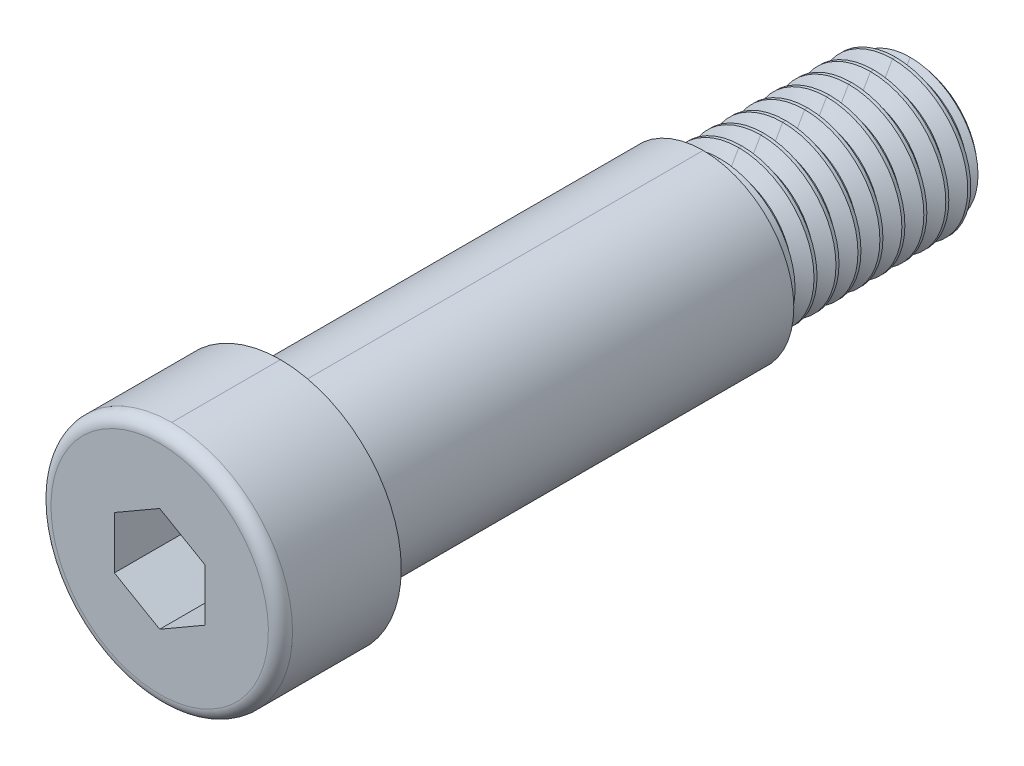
ISO-10303-21;
HEADER;
FILE_DESCRIPTION(('STEP AP214'),'2;1');
FILE_NAME('part.step','',(''),(''),'','','');
FILE_SCHEMA(('AUTOMOTIVE_DESIGN { 1 0 10303 214 1 1 1 1 }'));
ENDSEC;
DATA;
#1=APPLICATION_CONTEXT('core data for automotive mechanical design processes');
#2=APPLICATION_PROTOCOL_DEFINITION('international standard','automotive_design',2000,#1);
#3=PRODUCT_CONTEXT('',#1,'mechanical');
#4=PRODUCT('Part','Part','',(#3));
#5=PRODUCT_RELATED_PRODUCT_CATEGORY('part','',(#4));
#6=PRODUCT_DEFINITION_FORMATION('','',#4);
#7=PRODUCT_DEFINITION_CONTEXT('part definition',#1,'design');
#8=PRODUCT_DEFINITION('design','',#6,#7);
#9=PRODUCT_DEFINITION_SHAPE('','',#8);
#10=(LENGTH_UNIT() NAMED_UNIT(*) SI_UNIT(.MILLI.,.METRE.));
#11=(NAMED_UNIT(*) PLANE_ANGLE_UNIT() SI_UNIT($,.RADIAN.));
#12=(NAMED_UNIT(*) SI_UNIT($,.STERADIAN.) SOLID_ANGLE_UNIT());
#13=UNCERTAINTY_MEASURE_WITH_UNIT(LENGTH_MEASURE(1.E-05),#10,'distance_accuracy_value','');
#14=(GEOMETRIC_REPRESENTATION_CONTEXT(3) GLOBAL_UNCERTAINTY_ASSIGNED_CONTEXT((#13)) GLOBAL_UNIT_ASSIGNED_CONTEXT((#10,
#11,#12)) REPRESENTATION_CONTEXT('',''));
#15=CARTESIAN_POINT('',(0.,0.,0.));
#16=DIRECTION('',(0.,0.,1.));
#17=DIRECTION('',(1.,0.,0.));
#18=AXIS2_PLACEMENT_3D('',#15,#16,#17);
#19=CARTESIAN_POINT('',(0.,3.28950781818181,-39.6874999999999));
#20=DIRECTION('',(0.,0.,-1.));
#21=DIRECTION('',(-1.,0.,0.));
#22=AXIS2_PLACEMENT_3D('',#19,#20,#21);
#23=PLANE('',#22);
#24=CARTESIAN_POINT('',(0.,0.,-39.6874999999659));
#25=DIRECTION('',(0.,0.,1.));
#26=DIRECTION('',(1.,0.,0.));
#27=AXIS2_PLACEMENT_3D('',#24,#25,#26);
#28=CIRCLE('',#27,6.57901563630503);
#29=CARTESIAN_POINT('',(0.,-6.57901563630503,-39.6874999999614));
#30=VERTEX_POINT('',#29);
#31=CARTESIAN_POINT('',(0.,6.57901563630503,-39.6874999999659));
#32=VERTEX_POINT('',#31);
#33=EDGE_CURVE('E19',#30,#32,#28,.T.);
#34=ORIENTED_EDGE('',*,*,#33,.F.);
#35=CARTESIAN_POINT('',(0.,0.,-39.6874999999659));
#36=DIRECTION('',(0.,0.,1.));
#37=DIRECTION('',(1.,0.,0.));
#38=AXIS2_PLACEMENT_3D('',#35,#36,#37);
#39=CIRCLE('',#38,6.57901563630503);
#40=EDGE_CURVE('E305',#32,#30,#39,.T.);
#41=ORIENTED_EDGE('',*,*,#40,.F.);
#42=EDGE_LOOP('',(#34,#41));
#43=FACE_BOUND('',#42,.T.);
#44=ADVANCED_FACE('F16',(#43),#23,.T.);
#45=CARTESIAN_POINT('',(0.,0.,-39.2228709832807));
#46=DIRECTION('',(0.,0.,1.));
#47=DIRECTION('',(1.,0.,0.));
#48=AXIS2_PLACEMENT_3D('',#45,#46,#47);
#49=CONICAL_SURFACE('',#48,7.13273893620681,0.872664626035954);
#50=DIRECTION('',(0.,0.766044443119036,-0.64278760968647));
#51=VECTOR('',#50,1.);
#52=CARTESIAN_POINT('',(8.31381969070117E-11,-499000.,418665.508007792));
#53=LINE('',#52,#51);
#54=CARTESIAN_POINT('',(0.,-7.13273893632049,-39.2228709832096));
#55=VERTEX_POINT('',#54);
#56=EDGE_CURVE('E303',#30,#55,#53,.F.);
#57=ORIENTED_EDGE('',*,*,#56,.F.);
#58=ORIENTED_EDGE('',*,*,#33,.T.);
#59=DIRECTION('',(0.,-0.766044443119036,-0.64278760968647));
#60=VECTOR('',#59,1.);
#61=CARTESIAN_POINT('',(1.44246053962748E-10,499000.,418665.508007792));
#62=LINE('',#61,#60);
#63=CARTESIAN_POINT('',(0.,7.13273893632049,-39.2228709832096));
#64=VERTEX_POINT('',#63);
#65=EDGE_CURVE('E300',#64,#32,#62,.T.);
#66=ORIENTED_EDGE('',*,*,#65,.F.);
#67=CARTESIAN_POINT('',(0.,0.,-39.222870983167));
#68=DIRECTION('',(0.,0.,-1.));
#69=DIRECTION('',(0.,1.,0.));
#70=AXIS2_PLACEMENT_3D('',#67,#68,#69);
#71=CIRCLE('',#70,7.13273893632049);
#72=EDGE_CURVE('E1112',#55,#64,#71,.F.);
#73=ORIENTED_EDGE('',*,*,#72,.F.);
#74=EDGE_LOOP('',(#57,#58,#66,#73));
#75=FACE_BOUND('',#74,.T.);
#76=ADVANCED_FACE('F298',(#75),#49,.T.);
#77=CARTESIAN_POINT('',(0.,0.,-39.2228709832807));
#78=DIRECTION('',(0.,0.,1.));
#79=DIRECTION('',(1.,0.,0.));
#80=AXIS2_PLACEMENT_3D('',#77,#78,#79);
#81=CONICAL_SURFACE('',#80,7.13273893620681,0.872664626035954);
#82=ORIENTED_EDGE('',*,*,#56,.T.);
#83=CARTESIAN_POINT('',(0.,0.,-39.222870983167));
#84=DIRECTION('',(0.,0.,-1.));
#85=DIRECTION('',(0.,1.,0.));
#86=AXIS2_PLACEMENT_3D('',#83,#84,#85);
#87=CIRCLE('',#86,7.13273893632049);
#88=EDGE_CURVE('E310',#64,#55,#87,.F.);
#89=ORIENTED_EDGE('',*,*,#88,.F.);
#90=ORIENTED_EDGE('',*,*,#65,.T.);
#91=ORIENTED_EDGE('',*,*,#40,.T.);
#92=EDGE_LOOP('',(#82,#89,#90,#91));
#93=FACE_BOUND('',#92,.T.);
#94=ADVANCED_FACE('F308',(#93),#81,.T.);
#95=CARTESIAN_POINT('',(0.,0.,-39.2228709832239));
#96=DIRECTION('',(0.,0.,-1.));
#97=DIRECTION('',(-1.,0.,0.));
#98=AXIS2_PLACEMENT_3D('',#95,#96,#97);
#99=CONICAL_SURFACE('',#98,7.13273893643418,1.04719755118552);
#100=DIRECTION('',(0.,0.86602540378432,0.500000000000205));
#101=VECTOR('',#100,1.);
#102=CARTESIAN_POINT('',(-3.81419898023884E-11,-499000.,-288132.889108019));
#103=LINE('',#102,#101);
#104=CARTESIAN_POINT('',(0.,-6.43751454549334,-38.8214829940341));
#105=VERTEX_POINT('',#104);
#106=EDGE_CURVE('E1099',#55,#105,#103,.T.);
#107=ORIENTED_EDGE('',*,*,#106,.F.);
#108=ORIENTED_EDGE('',*,*,#72,.T.);
#109=DIRECTION('',(0.,-0.86602540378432,0.500000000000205));
#110=VECTOR('',#109,1.);
#111=CARTESIAN_POINT('',(-9.9249846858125E-11,499000.,-288132.889108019));
#112=LINE('',#111,#110);
#113=CARTESIAN_POINT('',(0.,6.43751454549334,-38.8214829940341));
#114=VERTEX_POINT('',#113);
#115=EDGE_CURVE('E1110',#114,#64,#112,.F.);
#116=ORIENTED_EDGE('',*,*,#115,.F.);
#117=CARTESIAN_POINT('',(0.,0.,-38.8214829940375));
#118=DIRECTION('',(0.,0.,-1.));
#119=DIRECTION('',(-1.,0.,0.));
#120=AXIS2_PLACEMENT_3D('',#117,#118,#119);
#121=CIRCLE('',#120,6.43751454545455);
#122=EDGE_CURVE('E1094',#105,#114,#121,.F.);
#123=ORIENTED_EDGE('',*,*,#122,.F.);
#124=EDGE_LOOP('',(#107,#108,#116,#123));
#125=FACE_BOUND('',#124,.T.);
#126=ADVANCED_FACE('F1122',(#125),#99,.T.);
#127=CARTESIAN_POINT('',(0.,0.,-39.2228709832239));
#128=DIRECTION('',(0.,0.,-1.));
#129=DIRECTION('',(-1.,0.,0.));
#130=AXIS2_PLACEMENT_3D('',#127,#128,#129);
#131=CONICAL_SURFACE('',#130,7.13273893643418,1.04719755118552);
#132=ORIENTED_EDGE('',*,*,#106,.T.);
#133=CARTESIAN_POINT('',(0.,0.,-38.8214829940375));
#134=DIRECTION('',(0.,0.,-1.));
#135=DIRECTION('',(-1.,0.,0.));
#136=AXIS2_PLACEMENT_3D('',#133,#134,#135);
#137=CIRCLE('',#136,6.43751454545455);
#138=EDGE_CURVE('E1088',#114,#105,#137,.F.);
#139=ORIENTED_EDGE('',*,*,#138,.F.);
#140=ORIENTED_EDGE('',*,*,#115,.T.);
#141=ORIENTED_EDGE('',*,*,#88,.T.);
#142=EDGE_LOOP('',(#132,#139,#140,#141));
#143=FACE_BOUND('',#142,.T.);
#144=ADVANCED_FACE('F1126',(#143),#131,.T.);
#145=CARTESIAN_POINT('',(0.,0.,-38.6772727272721));
#146=DIRECTION('',(0.,0.,-1.));
#147=DIRECTION('',(-1.,0.,0.));
#148=AXIS2_PLACEMENT_3D('',#145,#146,#147);
#149=CYLINDRICAL_SURFACE('',#148,6.43751454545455);
#150=DIRECTION('',(0.,0.,-1.));
#151=VECTOR('',#150,1.);
#152=CARTESIAN_POINT('',(0.,-6.43751454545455,-38.6772727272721));
#153=LINE('',#152,#151);
#154=CARTESIAN_POINT('',(0.,-6.43751454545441,-38.5330624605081));
#155=VERTEX_POINT('',#154);
#156=EDGE_CURVE('E1079',#105,#155,#153,.F.);
#157=ORIENTED_EDGE('',*,*,#156,.F.);
#158=ORIENTED_EDGE('',*,*,#122,.T.);
#159=DIRECTION('',(0.,0.,-1.));
#160=VECTOR('',#159,1.);
#161=CARTESIAN_POINT('',(0.,6.43751454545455,-38.6772727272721));
#162=LINE('',#161,#160);
#163=CARTESIAN_POINT('',(0.,6.43751454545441,-38.533062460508));
#164=VERTEX_POINT('',#163);
#165=EDGE_CURVE('E1091',#164,#114,#162,.T.);
#166=ORIENTED_EDGE('',*,*,#165,.F.);
#167=CARTESIAN_POINT('',(0.,0.,-38.533062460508));
#168=DIRECTION('',(0.,0.,1.));
#169=DIRECTION('',(0.,1.,0.));
#170=AXIS2_PLACEMENT_3D('',#167,#168,#169);
#171=CIRCLE('',#170,6.43751454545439);
#172=EDGE_CURVE('E1074',#155,#164,#171,.T.);
#173=ORIENTED_EDGE('',*,*,#172,.F.);
#174=EDGE_LOOP('',(#157,#158,#166,#173));
#175=FACE_BOUND('',#174,.T.);
#176=ADVANCED_FACE('F1128',(#175),#149,.T.);
#177=CARTESIAN_POINT('',(0.,0.,-38.6772727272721));
#178=DIRECTION('',(0.,0.,-1.));
#179=DIRECTION('',(-1.,0.,0.));
#180=AXIS2_PLACEMENT_3D('',#177,#178,#179);
#181=CYLINDRICAL_SURFACE('',#180,6.43751454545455);
#182=ORIENTED_EDGE('',*,*,#156,.T.);
#183=CARTESIAN_POINT('',(0.,0.,-38.533062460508));
#184=DIRECTION('',(0.,0.,1.));
#185=DIRECTION('',(0.,1.,0.));
#186=AXIS2_PLACEMENT_3D('',#183,#184,#185);
#187=CIRCLE('',#186,6.43751454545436);
#188=EDGE_CURVE('E1068',#164,#155,#187,.T.);
#189=ORIENTED_EDGE('',*,*,#188,.F.);
#190=ORIENTED_EDGE('',*,*,#165,.T.);
#191=ORIENTED_EDGE('',*,*,#138,.T.);
#192=EDGE_LOOP('',(#182,#189,#190,#191));
#193=FACE_BOUND('',#192,.T.);
#194=ADVANCED_FACE('F1132',(#193),#181,.T.);
#195=CARTESIAN_POINT('',(0.,0.,-37.6814701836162));
#196=DIRECTION('',(0.,0.,1.));
#197=DIRECTION('',(1.,0.,0.));
#198=AXIS2_PLACEMENT_3D('',#195,#196,#197);
#199=CONICAL_SURFACE('',#198,7.91251563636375,1.04719755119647);
#200=DIRECTION('',(0.,0.866025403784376,-0.500000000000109));
#201=VECTOR('',#200,1.);
#202=CARTESIAN_POINT('',(0.,-7.1750150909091,-38.1072663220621));
#203=LINE('',#202,#201);
#204=CARTESIAN_POINT('',(0.,-7.91251563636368,-37.681470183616));
#205=VERTEX_POINT('',#204);
#206=EDGE_CURVE('E1059',#155,#205,#203,.F.);
#207=ORIENTED_EDGE('',*,*,#206,.F.);
#208=ORIENTED_EDGE('',*,*,#172,.T.);
#209=DIRECTION('',(0.,-0.866025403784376,-0.500000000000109));
#210=VECTOR('',#209,1.);
#211=CARTESIAN_POINT('',(0.,7.1750150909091,-38.1072663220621));
#212=LINE('',#211,#210);
#213=CARTESIAN_POINT('',(0.,7.91251563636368,-37.681470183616));
#214=VERTEX_POINT('',#213);
#215=EDGE_CURVE('E1071',#214,#164,#212,.T.);
#216=ORIENTED_EDGE('',*,*,#215,.F.);
#217=CARTESIAN_POINT('',(0.,0.,-37.6814701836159));
#218=DIRECTION('',(0.,0.,-1.));
#219=DIRECTION('',(-1.,0.,0.));
#220=AXIS2_PLACEMENT_3D('',#217,#218,#219);
#221=CIRCLE('',#220,7.91251563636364);
#222=EDGE_CURVE('E1054',#205,#214,#221,.F.);
#223=ORIENTED_EDGE('',*,*,#222,.F.);
#224=EDGE_LOOP('',(#207,#208,#216,#223));
#225=FACE_BOUND('',#224,.T.);
#226=ADVANCED_FACE('F1137',(#225),#199,.T.);
#227=CARTESIAN_POINT('',(0.,0.,-37.6814701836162));
#228=DIRECTION('',(0.,0.,1.));
#229=DIRECTION('',(1.,0.,0.));
#230=AXIS2_PLACEMENT_3D('',#227,#228,#229);
#231=CONICAL_SURFACE('',#230,7.9125156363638,1.04719755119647);
#232=ORIENTED_EDGE('',*,*,#206,.T.);
#233=CARTESIAN_POINT('',(0.,0.,-37.6814701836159));
#234=DIRECTION('',(0.,0.,-1.));
#235=DIRECTION('',(-1.,0.,0.));
#236=AXIS2_PLACEMENT_3D('',#233,#234,#235);
#237=CIRCLE('',#236,7.91251563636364);
#238=EDGE_CURVE('E1048',#214,#205,#237,.F.);
#239=ORIENTED_EDGE('',*,*,#238,.F.);
#240=ORIENTED_EDGE('',*,*,#215,.T.);
#241=ORIENTED_EDGE('',*,*,#188,.T.);
#242=EDGE_LOOP('',(#232,#239,#240,#241));
#243=FACE_BOUND('',#242,.T.);
#244=ADVANCED_FACE('F1135',(#243),#231,.T.);
#245=CARTESIAN_POINT('',(0.,0.,-37.5227272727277));
#246=DIRECTION('',(0.,0.,-1.));
#247=DIRECTION('',(-1.,0.,0.));
#248=AXIS2_PLACEMENT_3D('',#245,#246,#247);
#249=CYLINDRICAL_SURFACE('',#248,7.91251563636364);
#250=DIRECTION('',(0.,0.,-1.));
#251=VECTOR('',#250,1.);
#252=CARTESIAN_POINT('',(0.,-7.91251563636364,-37.5227272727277));
#253=LINE('',#252,#251);
#254=CARTESIAN_POINT('',(0.,-7.91251563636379,-37.3639843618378));
#255=VERTEX_POINT('',#254);
#256=EDGE_CURVE('E1039',#205,#255,#253,.F.);
#257=ORIENTED_EDGE('',*,*,#256,.F.);
#258=ORIENTED_EDGE('',*,*,#222,.T.);
#259=DIRECTION('',(0.,0.,-1.));
#260=VECTOR('',#259,1.);
#261=CARTESIAN_POINT('',(0.,7.91251563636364,-37.5227272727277));
#262=LINE('',#261,#260);
#263=CARTESIAN_POINT('',(0.,7.91251563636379,-37.3639843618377));
#264=VERTEX_POINT('',#263);
#265=EDGE_CURVE('E1051',#264,#214,#262,.T.);
#266=ORIENTED_EDGE('',*,*,#265,.F.);
#267=CARTESIAN_POINT('',(0.,0.,-37.3639843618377));
#268=DIRECTION('',(0.,0.,-1.));
#269=DIRECTION('',(0.,1.,0.));
#270=AXIS2_PLACEMENT_3D('',#267,#268,#269);
#271=CIRCLE('',#270,7.91251563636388);
#272=EDGE_CURVE('E1034',#255,#264,#271,.F.);
#273=ORIENTED_EDGE('',*,*,#272,.F.);
#274=EDGE_LOOP('',(#257,#258,#266,#273));
#275=FACE_BOUND('',#274,.T.);
#276=ADVANCED_FACE('F1140',(#275),#249,.T.);
#277=CARTESIAN_POINT('',(0.,0.,-37.5227272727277));
#278=DIRECTION('',(0.,0.,-1.));
#279=DIRECTION('',(-1.,0.,0.));
#280=AXIS2_PLACEMENT_3D('',#277,#278,#279);
#281=CYLINDRICAL_SURFACE('',#280,7.91251563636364);
#282=ORIENTED_EDGE('',*,*,#256,.T.);
#283=CARTESIAN_POINT('',(0.,0.,-37.3639843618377));
#284=DIRECTION('',(0.,0.,-1.));
#285=DIRECTION('',(0.,1.,0.));
#286=AXIS2_PLACEMENT_3D('',#283,#284,#285);
#287=CIRCLE('',#286,7.91251563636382);
#288=EDGE_CURVE('E1028',#264,#255,#287,.F.);
#289=ORIENTED_EDGE('',*,*,#288,.F.);
#290=ORIENTED_EDGE('',*,*,#265,.T.);
#291=ORIENTED_EDGE('',*,*,#238,.T.);
#292=EDGE_LOOP('',(#282,#289,#290,#291));
#293=FACE_BOUND('',#292,.T.);
#294=ADVANCED_FACE('F1144',(#293),#281,.T.);
#295=CARTESIAN_POINT('',(0.,0.,-37.3639843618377));
#296=DIRECTION('',(0.,0.,-1.));
#297=DIRECTION('',(-1.,0.,0.));
#298=AXIS2_PLACEMENT_3D('',#295,#296,#297);
#299=CONICAL_SURFACE('',#298,7.91251563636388,1.04719755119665);
#300=DIRECTION('',(0.,0.866025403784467,0.49999999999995));
#301=VECTOR('',#300,1.);
#302=CARTESIAN_POINT('',(0.,-7.1750150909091,-36.9381882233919));
#303=LINE('',#302,#301);
#304=CARTESIAN_POINT('',(0.,-6.43751454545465,-36.5123920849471));
#305=VERTEX_POINT('',#304);
#306=EDGE_CURVE('E1019',#255,#305,#303,.T.);
#307=ORIENTED_EDGE('',*,*,#306,.F.);
#308=ORIENTED_EDGE('',*,*,#272,.T.);
#309=DIRECTION('',(0.,-0.866025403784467,0.49999999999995));
#310=VECTOR('',#309,1.);
#311=CARTESIAN_POINT('',(0.,7.1750150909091,-36.9381882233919));
#312=LINE('',#311,#310);
#313=CARTESIAN_POINT('',(0.,6.43751454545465,-36.5123920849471));
#314=VERTEX_POINT('',#313);
#315=EDGE_CURVE('E1031',#314,#264,#312,.F.);
#316=ORIENTED_EDGE('',*,*,#315,.F.);
#317=CARTESIAN_POINT('',(0.,0.,-36.5123920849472));
#318=DIRECTION('',(0.,0.,-1.));
#319=DIRECTION('',(-1.,0.,0.));
#320=AXIS2_PLACEMENT_3D('',#317,#318,#319);
#321=CIRCLE('',#320,6.43751454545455);
#322=EDGE_CURVE('E1014',#305,#314,#321,.F.);
#323=ORIENTED_EDGE('',*,*,#322,.F.);
#324=EDGE_LOOP('',(#307,#308,#316,#323));
#325=FACE_BOUND('',#324,.T.);
#326=ADVANCED_FACE('F1149',(#325),#299,.T.);
#327=CARTESIAN_POINT('',(0.,0.,-37.3639843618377));
#328=DIRECTION('',(0.,0.,-1.));
#329=DIRECTION('',(-1.,0.,0.));
#330=AXIS2_PLACEMENT_3D('',#327,#328,#329);
#331=CONICAL_SURFACE('',#330,7.91251563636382,1.04719755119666);
#332=ORIENTED_EDGE('',*,*,#306,.T.);
#333=CARTESIAN_POINT('',(0.,0.,-36.5123920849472));
#334=DIRECTION('',(0.,0.,-1.));
#335=DIRECTION('',(-1.,0.,0.));
#336=AXIS2_PLACEMENT_3D('',#333,#334,#335);
#337=CIRCLE('',#336,6.43751454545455);
#338=EDGE_CURVE('E1008',#314,#305,#337,.F.);
#339=ORIENTED_EDGE('',*,*,#338,.F.);
#340=ORIENTED_EDGE('',*,*,#315,.T.);
#341=ORIENTED_EDGE('',*,*,#288,.T.);
#342=EDGE_LOOP('',(#332,#339,#340,#341));
#343=FACE_BOUND('',#342,.T.);
#344=ADVANCED_FACE('F1147',(#343),#331,.T.);
#345=CARTESIAN_POINT('',(0.,0.,-36.3681818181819));
#346=DIRECTION('',(0.,0.,-1.));
#347=DIRECTION('',(-1.,0.,0.));
#348=AXIS2_PLACEMENT_3D('',#345,#346,#347);
#349=CYLINDRICAL_SURFACE('',#348,6.43751454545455);
#350=DIRECTION('',(0.,0.,-1.));
#351=VECTOR('',#350,1.);
#352=CARTESIAN_POINT('',(0.,-6.43751454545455,-36.3681818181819));
#353=LINE('',#352,#351);
#354=CARTESIAN_POINT('',(0.,-6.43751454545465,-36.2239715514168));
#355=VERTEX_POINT('',#354);
#356=EDGE_CURVE('E999',#305,#355,#353,.F.);
#357=ORIENTED_EDGE('',*,*,#356,.F.);
#358=ORIENTED_EDGE('',*,*,#322,.T.);
#359=DIRECTION('',(0.,0.,-1.));
#360=VECTOR('',#359,1.);
#361=CARTESIAN_POINT('',(0.,6.43751454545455,-36.3681818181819));
#362=LINE('',#361,#360);
#363=CARTESIAN_POINT('',(0.,6.43751454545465,-36.2239715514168));
#364=VERTEX_POINT('',#363);
#365=EDGE_CURVE('E1011',#364,#314,#362,.T.);
#366=ORIENTED_EDGE('',*,*,#365,.F.);
#367=CARTESIAN_POINT('',(0.,0.,-36.2239715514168));
#368=DIRECTION('',(0.,0.,1.));
#369=DIRECTION('',(0.,1.,0.));
#370=AXIS2_PLACEMENT_3D('',#367,#368,#369);
#371=CIRCLE('',#370,6.43751454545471);
#372=EDGE_CURVE('E994',#355,#364,#371,.T.);
#373=ORIENTED_EDGE('',*,*,#372,.F.);
#374=EDGE_LOOP('',(#357,#358,#366,#373));
#375=FACE_BOUND('',#374,.T.);
#376=ADVANCED_FACE('F1152',(#375),#349,.T.);
#377=CARTESIAN_POINT('',(0.,0.,-36.3681818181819));
#378=DIRECTION('',(0.,0.,-1.));
#379=DIRECTION('',(-1.,0.,0.));
#380=AXIS2_PLACEMENT_3D('',#377,#378,#379);
#381=CYLINDRICAL_SURFACE('',#380,6.43751454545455);
#382=ORIENTED_EDGE('',*,*,#356,.T.);
#383=CARTESIAN_POINT('',(0.,0.,-36.2239715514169));
#384=DIRECTION('',(0.,0.,1.));
#385=DIRECTION('',(0.,1.,0.));
#386=AXIS2_PLACEMENT_3D('',#383,#384,#385);
#387=CIRCLE('',#386,6.43751454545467);
#388=EDGE_CURVE('E988',#364,#355,#387,.T.);
#389=ORIENTED_EDGE('',*,*,#388,.F.);
#390=ORIENTED_EDGE('',*,*,#365,.T.);
#391=ORIENTED_EDGE('',*,*,#338,.T.);
#392=EDGE_LOOP('',(#382,#389,#390,#391));
#393=FACE_BOUND('',#392,.T.);
#394=ADVANCED_FACE('F1156',(#393),#381,.T.);
#395=CARTESIAN_POINT('',(0.,0.,-35.3723792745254));
#396=DIRECTION('',(0.,0.,1.));
#397=DIRECTION('',(1.,0.,0.));
#398=AXIS2_PLACEMENT_3D('',#395,#396,#397);
#399=CONICAL_SURFACE('',#398,7.91251563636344,1.04719755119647);
#400=DIRECTION('',(0.,0.866025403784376,-0.500000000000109));
#401=VECTOR('',#400,1.);
#402=CARTESIAN_POINT('',(0.,-7.1750150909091,-35.7981754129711));
#403=LINE('',#402,#401);
#404=CARTESIAN_POINT('',(0.,-7.9125156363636,-35.3723792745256));
#405=VERTEX_POINT('',#404);
#406=EDGE_CURVE('E979',#355,#405,#403,.F.);
#407=ORIENTED_EDGE('',*,*,#406,.F.);
#408=ORIENTED_EDGE('',*,*,#372,.T.);
#409=DIRECTION('',(0.,-0.866025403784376,-0.500000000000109));
#410=VECTOR('',#409,1.);
#411=CARTESIAN_POINT('',(0.,7.1750150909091,-35.7981754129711));
#412=LINE('',#411,#410);
#413=CARTESIAN_POINT('',(0.,7.9125156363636,-35.3723792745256));
#414=VERTEX_POINT('',#413);
#415=EDGE_CURVE('E991',#414,#364,#412,.T.);
#416=ORIENTED_EDGE('',*,*,#415,.F.);
#417=CARTESIAN_POINT('',(0.,0.,-35.3723792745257));
#418=DIRECTION('',(0.,0.,-1.));
#419=DIRECTION('',(-1.,0.,0.));
#420=AXIS2_PLACEMENT_3D('',#417,#418,#419);
#421=CIRCLE('',#420,7.91251563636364);
#422=EDGE_CURVE('E974',#405,#414,#421,.F.);
#423=ORIENTED_EDGE('',*,*,#422,.F.);
#424=EDGE_LOOP('',(#407,#408,#416,#423));
#425=FACE_BOUND('',#424,.T.);
#426=ADVANCED_FACE('F1161',(#425),#399,.T.);
#427=CARTESIAN_POINT('',(0.,0.,-35.3723792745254));
#428=DIRECTION('',(0.,0.,1.));
#429=DIRECTION('',(1.,0.,0.));
#430=AXIS2_PLACEMENT_3D('',#427,#428,#429);
#431=CONICAL_SURFACE('',#430,7.91251563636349,1.04719755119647);
#432=ORIENTED_EDGE('',*,*,#406,.T.);
#433=CARTESIAN_POINT('',(0.,0.,-35.3723792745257));
#434=DIRECTION('',(0.,0.,-1.));
#435=DIRECTION('',(-1.,0.,0.));
#436=AXIS2_PLACEMENT_3D('',#433,#434,#435);
#437=CIRCLE('',#436,7.91251563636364);
#438=EDGE_CURVE('E968',#414,#405,#437,.F.);
#439=ORIENTED_EDGE('',*,*,#438,.F.);
#440=ORIENTED_EDGE('',*,*,#415,.T.);
#441=ORIENTED_EDGE('',*,*,#388,.T.);
#442=EDGE_LOOP('',(#432,#439,#440,#441));
#443=FACE_BOUND('',#442,.T.);
#444=ADVANCED_FACE('F1159',(#443),#431,.T.);
#445=CARTESIAN_POINT('',(0.,0.,-35.213636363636));
#446=DIRECTION('',(0.,0.,-1.));
#447=DIRECTION('',(-1.,0.,0.));
#448=AXIS2_PLACEMENT_3D('',#445,#446,#447);
#449=CYLINDRICAL_SURFACE('',#448,7.91251563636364);
#450=DIRECTION('',(0.,0.,-1.));
#451=VECTOR('',#450,1.);
#452=CARTESIAN_POINT('',(0.,-7.91251563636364,-35.213636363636));
#453=LINE('',#452,#451);
#454=CARTESIAN_POINT('',(0.,-7.91251563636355,-35.0548934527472));
#455=VERTEX_POINT('',#454);
#456=EDGE_CURVE('E959',#405,#455,#453,.F.);
#457=ORIENTED_EDGE('',*,*,#456,.F.);
#458=ORIENTED_EDGE('',*,*,#422,.T.);
#459=DIRECTION('',(0.,0.,-1.));
#460=VECTOR('',#459,1.);
#461=CARTESIAN_POINT('',(0.,7.91251563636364,-35.213636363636));
#462=LINE('',#461,#460);
#463=CARTESIAN_POINT('',(0.,7.91251563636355,-35.0548934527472));
#464=VERTEX_POINT('',#463);
#465=EDGE_CURVE('E971',#464,#414,#462,.T.);
#466=ORIENTED_EDGE('',*,*,#465,.F.);
#467=CARTESIAN_POINT('',(0.,0.,-35.0548934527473));
#468=DIRECTION('',(0.,0.,-1.));
#469=DIRECTION('',(0.,1.,0.));
#470=AXIS2_PLACEMENT_3D('',#467,#468,#469);
#471=CIRCLE('',#470,7.91251563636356);
#472=EDGE_CURVE('E954',#455,#464,#471,.F.);
#473=ORIENTED_EDGE('',*,*,#472,.F.);
#474=EDGE_LOOP('',(#457,#458,#466,#473));
#475=FACE_BOUND('',#474,.T.);
#476=ADVANCED_FACE('F1164',(#475),#449,.T.);
#477=CARTESIAN_POINT('',(0.,0.,-35.213636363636));
#478=DIRECTION('',(0.,0.,-1.));
#479=DIRECTION('',(-1.,0.,0.));
#480=AXIS2_PLACEMENT_3D('',#477,#478,#479);
#481=CYLINDRICAL_SURFACE('',#480,7.91251563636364);
#482=ORIENTED_EDGE('',*,*,#456,.T.);
#483=CARTESIAN_POINT('',(0.,0.,-35.0548934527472));
#484=DIRECTION('',(0.,0.,-1.));
#485=DIRECTION('',(0.,1.,0.));
#486=AXIS2_PLACEMENT_3D('',#483,#484,#485);
#487=CIRCLE('',#486,7.91251563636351);
#488=EDGE_CURVE('E948',#464,#455,#487,.F.);
#489=ORIENTED_EDGE('',*,*,#488,.F.);
#490=ORIENTED_EDGE('',*,*,#465,.T.);
#491=ORIENTED_EDGE('',*,*,#438,.T.);
#492=EDGE_LOOP('',(#482,#489,#490,#491));
#493=FACE_BOUND('',#492,.T.);
#494=ADVANCED_FACE('F1168',(#493),#481,.T.);
#495=CARTESIAN_POINT('',(0.,0.,-35.0548934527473));
#496=DIRECTION('',(0.,0.,-1.));
#497=DIRECTION('',(-1.,0.,0.));
#498=AXIS2_PLACEMENT_3D('',#495,#496,#497);
#499=CONICAL_SURFACE('',#498,7.91251563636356,1.04719755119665);
#500=DIRECTION('',(0.,0.866025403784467,0.49999999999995));
#501=VECTOR('',#500,1.);
#502=CARTESIAN_POINT('',(0.,-7.1750150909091,-34.6290973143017));
#503=LINE('',#502,#501);
#504=CARTESIAN_POINT('',(0.,-6.43751454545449,-34.2033011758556));
#505=VERTEX_POINT('',#504);
#506=EDGE_CURVE('E939',#455,#505,#503,.T.);
#507=ORIENTED_EDGE('',*,*,#506,.F.);
#508=ORIENTED_EDGE('',*,*,#472,.T.);
#509=DIRECTION('',(0.,-0.866025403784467,0.49999999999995));
#510=VECTOR('',#509,1.);
#511=CARTESIAN_POINT('',(0.,7.1750150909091,-34.6290973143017));
#512=LINE('',#511,#510);
#513=CARTESIAN_POINT('',(0.,6.43751454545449,-34.2033011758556));
#514=VERTEX_POINT('',#513);
#515=EDGE_CURVE('E951',#514,#464,#512,.F.);
#516=ORIENTED_EDGE('',*,*,#515,.F.);
#517=CARTESIAN_POINT('',(0.,0.,-34.2033011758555));
#518=DIRECTION('',(0.,0.,-1.));
#519=DIRECTION('',(-1.,0.,0.));
#520=AXIS2_PLACEMENT_3D('',#517,#518,#519);
#521=CIRCLE('',#520,6.43751454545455);
#522=EDGE_CURVE('E934',#505,#514,#521,.F.);
#523=ORIENTED_EDGE('',*,*,#522,.F.);
#524=EDGE_LOOP('',(#507,#508,#516,#523));
#525=FACE_BOUND('',#524,.T.);
#526=ADVANCED_FACE('F1173',(#525),#499,.T.);
#527=CARTESIAN_POINT('',(0.,0.,-35.0548934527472));
#528=DIRECTION('',(0.,0.,-1.));
#529=DIRECTION('',(-1.,0.,0.));
#530=AXIS2_PLACEMENT_3D('',#527,#528,#529);
#531=CONICAL_SURFACE('',#530,7.91251563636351,1.04719755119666);
#532=ORIENTED_EDGE('',*,*,#506,.T.);
#533=CARTESIAN_POINT('',(0.,0.,-34.2033011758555));
#534=DIRECTION('',(0.,0.,-1.));
#535=DIRECTION('',(-1.,0.,0.));
#536=AXIS2_PLACEMENT_3D('',#533,#534,#535);
#537=CIRCLE('',#536,6.43751454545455);
#538=EDGE_CURVE('E928',#514,#505,#537,.F.);
#539=ORIENTED_EDGE('',*,*,#538,.F.);
#540=ORIENTED_EDGE('',*,*,#515,.T.);
#541=ORIENTED_EDGE('',*,*,#488,.T.);
#542=EDGE_LOOP('',(#532,#539,#540,#541));
#543=FACE_BOUND('',#542,.T.);
#544=ADVANCED_FACE('F1171',(#543),#531,.T.);
#545=CARTESIAN_POINT('',(0.,0.,-34.0590909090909));
#546=DIRECTION('',(0.,0.,-1.));
#547=DIRECTION('',(-1.,0.,0.));
#548=AXIS2_PLACEMENT_3D('',#545,#546,#547);
#549=CYLINDRICAL_SURFACE('',#548,6.43751454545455);
#550=DIRECTION('',(0.,0.,-1.));
#551=VECTOR('',#550,1.);
#552=CARTESIAN_POINT('',(0.,-6.43751454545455,-34.0590909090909));
#553=LINE('',#552,#551);
#554=CARTESIAN_POINT('',(0.,-6.43751454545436,-33.914880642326));
#555=VERTEX_POINT('',#554);
#556=EDGE_CURVE('E919',#505,#555,#553,.F.);
#557=ORIENTED_EDGE('',*,*,#556,.F.);
#558=ORIENTED_EDGE('',*,*,#522,.T.);
#559=DIRECTION('',(0.,0.,-1.));
#560=VECTOR('',#559,1.);
#561=CARTESIAN_POINT('',(0.,6.43751454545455,-34.0590909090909));
#562=LINE('',#561,#560);
#563=CARTESIAN_POINT('',(0.,6.43751454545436,-33.9148806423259));
#564=VERTEX_POINT('',#563);
#565=EDGE_CURVE('E931',#564,#514,#562,.T.);
#566=ORIENTED_EDGE('',*,*,#565,.F.);
#567=CARTESIAN_POINT('',(0.,0.,-33.9148806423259));
#568=DIRECTION('',(0.,0.,1.));
#569=DIRECTION('',(0.,1.,0.));
#570=AXIS2_PLACEMENT_3D('',#567,#568,#569);
#571=CIRCLE('',#570,6.43751454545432);
#572=EDGE_CURVE('E914',#555,#564,#571,.T.);
#573=ORIENTED_EDGE('',*,*,#572,.F.);
#574=EDGE_LOOP('',(#557,#558,#566,#573));
#575=FACE_BOUND('',#574,.T.);
#576=ADVANCED_FACE('F1176',(#575),#549,.T.);
#577=CARTESIAN_POINT('',(0.,0.,-34.0590909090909));
#578=DIRECTION('',(0.,0.,-1.));
#579=DIRECTION('',(-1.,0.,0.));
#580=AXIS2_PLACEMENT_3D('',#577,#578,#579);
#581=CYLINDRICAL_SURFACE('',#580,6.43751454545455);
#582=ORIENTED_EDGE('',*,*,#556,.T.);
#583=CARTESIAN_POINT('',(0.,0.,-33.9148806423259));
#584=DIRECTION('',(0.,0.,1.));
#585=DIRECTION('',(0.,1.,0.));
#586=AXIS2_PLACEMENT_3D('',#583,#584,#585);
#587=CIRCLE('',#586,6.43751454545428);
#588=EDGE_CURVE('E908',#564,#555,#587,.T.);
#589=ORIENTED_EDGE('',*,*,#588,.F.);
#590=ORIENTED_EDGE('',*,*,#565,.T.);
#591=ORIENTED_EDGE('',*,*,#538,.T.);
#592=EDGE_LOOP('',(#582,#589,#590,#591));
#593=FACE_BOUND('',#592,.T.);
#594=ADVANCED_FACE('F1180',(#593),#581,.T.);
#595=CARTESIAN_POINT('',(0.,0.,-33.0632883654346));
#596=DIRECTION('',(0.,0.,1.));
#597=DIRECTION('',(1.,0.,0.));
#598=AXIS2_PLACEMENT_3D('',#595,#596,#597);
#599=CONICAL_SURFACE('',#598,7.91251563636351,1.04719755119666);
#600=DIRECTION('',(0.,0.866025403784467,-0.49999999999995));
#601=VECTOR('',#600,1.);
#602=CARTESIAN_POINT('',(0.,-7.1750150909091,-33.4890845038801));
#603=LINE('',#602,#601);
#604=CARTESIAN_POINT('',(0.,-7.91251563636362,-33.0632883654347));
#605=VERTEX_POINT('',#604);
#606=EDGE_CURVE('E899',#555,#605,#603,.F.);
#607=ORIENTED_EDGE('',*,*,#606,.F.);
#608=ORIENTED_EDGE('',*,*,#572,.T.);
#609=DIRECTION('',(0.,-0.866025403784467,-0.49999999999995));
#610=VECTOR('',#609,1.);
#611=CARTESIAN_POINT('',(0.,7.1750150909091,-33.4890845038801));
#612=LINE('',#611,#610);
#613=CARTESIAN_POINT('',(0.,7.91251563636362,-33.0632883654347));
#614=VERTEX_POINT('',#613);
#615=EDGE_CURVE('E911',#614,#564,#612,.T.);
#616=ORIENTED_EDGE('',*,*,#615,.F.);
#617=CARTESIAN_POINT('',(0.,0.,-33.0632883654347));
#618=DIRECTION('',(0.,0.,-1.));
#619=DIRECTION('',(-1.,0.,0.));
#620=AXIS2_PLACEMENT_3D('',#617,#618,#619);
#621=CIRCLE('',#620,7.91251563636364);
#622=EDGE_CURVE('E894',#605,#614,#621,.F.);
#623=ORIENTED_EDGE('',*,*,#622,.F.);
#624=EDGE_LOOP('',(#607,#608,#616,#623));
#625=FACE_BOUND('',#624,.T.);
#626=ADVANCED_FACE('F1185',(#625),#599,.T.);
#627=CARTESIAN_POINT('',(0.,0.,-33.0632883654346));
#628=DIRECTION('',(0.,0.,1.));
#629=DIRECTION('',(1.,0.,0.));
#630=AXIS2_PLACEMENT_3D('',#627,#628,#629);
#631=CONICAL_SURFACE('',#630,7.91251563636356,1.04719755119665);
#632=ORIENTED_EDGE('',*,*,#606,.T.);
#633=CARTESIAN_POINT('',(0.,0.,-33.0632883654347));
#634=DIRECTION('',(0.,0.,-1.));
#635=DIRECTION('',(-1.,0.,0.));
#636=AXIS2_PLACEMENT_3D('',#633,#634,#635);
#637=CIRCLE('',#636,7.91251563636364);
#638=EDGE_CURVE('E888',#614,#605,#637,.F.);
#639=ORIENTED_EDGE('',*,*,#638,.F.);
#640=ORIENTED_EDGE('',*,*,#615,.T.);
#641=ORIENTED_EDGE('',*,*,#588,.T.);
#642=EDGE_LOOP('',(#632,#639,#640,#641));
#643=FACE_BOUND('',#642,.T.);
#644=ADVANCED_FACE('F1183',(#643),#631,.T.);
#645=CARTESIAN_POINT('',(0.,0.,-32.9045454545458));
#646=DIRECTION('',(0.,0.,-1.));
#647=DIRECTION('',(-1.,0.,0.));
#648=AXIS2_PLACEMENT_3D('',#645,#646,#647);
#649=CYLINDRICAL_SURFACE('',#648,7.91251563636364);
#650=DIRECTION('',(0.,0.,-1.));
#651=VECTOR('',#650,1.);
#652=CARTESIAN_POINT('',(0.,-7.91251563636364,-32.9045454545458));
#653=LINE('',#652,#651);
#654=CARTESIAN_POINT('',(0.,-7.91251563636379,-32.7458025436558));
#655=VERTEX_POINT('',#654);
#656=EDGE_CURVE('E879',#605,#655,#653,.F.);
#657=ORIENTED_EDGE('',*,*,#656,.F.);
#658=ORIENTED_EDGE('',*,*,#622,.T.);
#659=DIRECTION('',(0.,0.,-1.));
#660=VECTOR('',#659,1.);
#661=CARTESIAN_POINT('',(0.,7.91251563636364,-32.9045454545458));
#662=LINE('',#661,#660);
#663=CARTESIAN_POINT('',(0.,7.91251563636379,-32.7458025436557));
#664=VERTEX_POINT('',#663);
#665=EDGE_CURVE('E891',#664,#614,#662,.T.);
#666=ORIENTED_EDGE('',*,*,#665,.F.);
#667=CARTESIAN_POINT('',(0.,0.,-32.7458025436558));
#668=DIRECTION('',(0.,0.,-1.));
#669=DIRECTION('',(0.,1.,0.));
#670=AXIS2_PLACEMENT_3D('',#667,#668,#669);
#671=CIRCLE('',#670,7.91251563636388);
#672=EDGE_CURVE('E874',#655,#664,#671,.F.);
#673=ORIENTED_EDGE('',*,*,#672,.F.);
#674=EDGE_LOOP('',(#657,#658,#666,#673));
#675=FACE_BOUND('',#674,.T.);
#676=ADVANCED_FACE('F1188',(#675),#649,.T.);
#677=CARTESIAN_POINT('',(0.,0.,-32.9045454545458));
#678=DIRECTION('',(0.,0.,-1.));
#679=DIRECTION('',(-1.,0.,0.));
#680=AXIS2_PLACEMENT_3D('',#677,#678,#679);
#681=CYLINDRICAL_SURFACE('',#680,7.91251563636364);
#682=ORIENTED_EDGE('',*,*,#656,.T.);
#683=CARTESIAN_POINT('',(0.,0.,-32.7458025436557));
#684=DIRECTION('',(0.,0.,-1.));
#685=DIRECTION('',(0.,1.,0.));
#686=AXIS2_PLACEMENT_3D('',#683,#684,#685);
#687=CIRCLE('',#686,7.91251563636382);
#688=EDGE_CURVE('E868',#664,#655,#687,.F.);
#689=ORIENTED_EDGE('',*,*,#688,.F.);
#690=ORIENTED_EDGE('',*,*,#665,.T.);
#691=ORIENTED_EDGE('',*,*,#638,.T.);
#692=EDGE_LOOP('',(#682,#689,#690,#691));
#693=FACE_BOUND('',#692,.T.);
#694=ADVANCED_FACE('F1192',(#693),#681,.T.);
#695=CARTESIAN_POINT('',(0.,0.,-32.7458025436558));
#696=DIRECTION('',(0.,0.,-1.));
#697=DIRECTION('',(-1.,0.,0.));
#698=AXIS2_PLACEMENT_3D('',#695,#696,#697);
#699=CONICAL_SURFACE('',#698,7.91251563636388,1.04719755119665);
#700=DIRECTION('',(0.,0.866025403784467,0.49999999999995));
#701=VECTOR('',#700,1.);
#702=CARTESIAN_POINT('',(0.,-7.1750150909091,-32.32000640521));
#703=LINE('',#702,#701);
#704=CARTESIAN_POINT('',(0.,-6.43751454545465,-31.8942102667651));
#705=VERTEX_POINT('',#704);
#706=EDGE_CURVE('E859',#655,#705,#703,.T.);
#707=ORIENTED_EDGE('',*,*,#706,.F.);
#708=ORIENTED_EDGE('',*,*,#672,.T.);
#709=DIRECTION('',(0.,-0.866025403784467,0.49999999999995));
#710=VECTOR('',#709,1.);
#711=CARTESIAN_POINT('',(0.,7.1750150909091,-32.32000640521));
#712=LINE('',#711,#710);
#713=CARTESIAN_POINT('',(0.,6.43751454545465,-31.8942102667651));
#714=VERTEX_POINT('',#713);
#715=EDGE_CURVE('E871',#714,#664,#712,.F.);
#716=ORIENTED_EDGE('',*,*,#715,.F.);
#717=CARTESIAN_POINT('',(0.,0.,-31.8942102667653));
#718=DIRECTION('',(0.,0.,-1.));
#719=DIRECTION('',(-1.,0.,0.));
#720=AXIS2_PLACEMENT_3D('',#717,#718,#719);
#721=CIRCLE('',#720,6.43751454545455);
#722=EDGE_CURVE('E854',#705,#714,#721,.F.);
#723=ORIENTED_EDGE('',*,*,#722,.F.);
#724=EDGE_LOOP('',(#707,#708,#716,#723));
#725=FACE_BOUND('',#724,.T.);
#726=ADVANCED_FACE('F1197',(#725),#699,.T.);
#727=CARTESIAN_POINT('',(0.,0.,-32.7458025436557));
#728=DIRECTION('',(0.,0.,-1.));
#729=DIRECTION('',(-1.,0.,0.));
#730=AXIS2_PLACEMENT_3D('',#727,#728,#729);
#731=CONICAL_SURFACE('',#730,7.91251563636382,1.04719755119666);
#732=ORIENTED_EDGE('',*,*,#706,.T.);
#733=CARTESIAN_POINT('',(0.,0.,-31.8942102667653));
#734=DIRECTION('',(0.,0.,-1.));
#735=DIRECTION('',(-1.,0.,0.));
#736=AXIS2_PLACEMENT_3D('',#733,#734,#735);
#737=CIRCLE('',#736,6.43751454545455);
#738=EDGE_CURVE('E848',#714,#705,#737,.F.);
#739=ORIENTED_EDGE('',*,*,#738,.F.);
#740=ORIENTED_EDGE('',*,*,#715,.T.);
#741=ORIENTED_EDGE('',*,*,#688,.T.);
#742=EDGE_LOOP('',(#732,#739,#740,#741));
#743=FACE_BOUND('',#742,.T.);
#744=ADVANCED_FACE('F1195',(#743),#731,.T.);
#745=CARTESIAN_POINT('',(0.,0.,-31.7499999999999));
#746=DIRECTION('',(0.,0.,-1.));
#747=DIRECTION('',(-1.,0.,0.));
#748=AXIS2_PLACEMENT_3D('',#745,#746,#747);
#749=CYLINDRICAL_SURFACE('',#748,6.43751454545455);
#750=DIRECTION('',(0.,0.,-1.));
#751=VECTOR('',#750,1.);
#752=CARTESIAN_POINT('',(0.,-6.43751454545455,-31.7499999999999));
#753=LINE('',#752,#751);
#754=CARTESIAN_POINT('',(0.,-6.43751454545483,-31.6057897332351));
#755=VERTEX_POINT('',#754);
#756=EDGE_CURVE('E839',#705,#755,#753,.F.);
#757=ORIENTED_EDGE('',*,*,#756,.F.);
#758=ORIENTED_EDGE('',*,*,#722,.T.);
#759=DIRECTION('',(0.,0.,-1.));
#760=VECTOR('',#759,1.);
#761=CARTESIAN_POINT('',(0.,6.43751454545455,-31.7499999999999));
#762=LINE('',#761,#760);
#763=CARTESIAN_POINT('',(0.,6.43751454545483,-31.6057897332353));
#764=VERTEX_POINT('',#763);
#765=EDGE_CURVE('E851',#764,#714,#762,.T.);
#766=ORIENTED_EDGE('',*,*,#765,.F.);
#767=CARTESIAN_POINT('',(0.,0.,-31.6057897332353));
#768=DIRECTION('',(0.,0.,1.));
#769=DIRECTION('',(0.,1.,0.));
#770=AXIS2_PLACEMENT_3D('',#767,#768,#769);
#771=CIRCLE('',#770,6.43751454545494);
#772=EDGE_CURVE('E834',#755,#764,#771,.T.);
#773=ORIENTED_EDGE('',*,*,#772,.F.);
#774=EDGE_LOOP('',(#757,#758,#766,#773));
#775=FACE_BOUND('',#774,.T.);
#776=ADVANCED_FACE('F1200',(#775),#749,.T.);
#777=CARTESIAN_POINT('',(0.,0.,-31.7499999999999));
#778=DIRECTION('',(0.,0.,-1.));
#779=DIRECTION('',(-1.,0.,0.));
#780=AXIS2_PLACEMENT_3D('',#777,#778,#779);
#781=CYLINDRICAL_SURFACE('',#780,6.43751454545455);
#782=ORIENTED_EDGE('',*,*,#756,.T.);
#783=CARTESIAN_POINT('',(0.,0.,-31.6057897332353));
#784=DIRECTION('',(0.,0.,1.));
#785=DIRECTION('',(0.,1.,0.));
#786=AXIS2_PLACEMENT_3D('',#783,#784,#785);
#787=CIRCLE('',#786,6.43751454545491);
#788=EDGE_CURVE('E828',#764,#755,#787,.T.);
#789=ORIENTED_EDGE('',*,*,#788,.F.);
#790=ORIENTED_EDGE('',*,*,#765,.T.);
#791=ORIENTED_EDGE('',*,*,#738,.T.);
#792=EDGE_LOOP('',(#782,#789,#790,#791));
#793=FACE_BOUND('',#792,.T.);
#794=ADVANCED_FACE('F1204',(#793),#781,.T.);
#795=CARTESIAN_POINT('',(0.,0.,-30.7541974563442));
#796=DIRECTION('',(0.,0.,1.));
#797=DIRECTION('',(1.,0.,0.));
#798=AXIS2_PLACEMENT_3D('',#795,#796,#797);
#799=CONICAL_SURFACE('',#798,7.91251563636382,1.04719755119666);
#800=DIRECTION('',(0.,0.866025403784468,-0.49999999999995));
#801=VECTOR('',#800,1.);
#802=CARTESIAN_POINT('',(0.,-7.1750150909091,-31.1799935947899));
#803=LINE('',#802,#801);
#804=CARTESIAN_POINT('',(0.,-7.9125156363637,-30.7541974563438));
#805=VERTEX_POINT('',#804);
#806=EDGE_CURVE('E819',#755,#805,#803,.F.);
#807=ORIENTED_EDGE('',*,*,#806,.F.);
#808=ORIENTED_EDGE('',*,*,#772,.T.);
#809=DIRECTION('',(0.,-0.866025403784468,-0.49999999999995));
#810=VECTOR('',#809,1.);
#811=CARTESIAN_POINT('',(0.,7.1750150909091,-31.1799935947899));
#812=LINE('',#811,#810);
#813=CARTESIAN_POINT('',(0.,7.9125156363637,-30.7541974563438));
#814=VERTEX_POINT('',#813);
#815=EDGE_CURVE('E831',#814,#764,#812,.T.);
#816=ORIENTED_EDGE('',*,*,#815,.F.);
#817=CARTESIAN_POINT('',(0.,0.,-30.7541974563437));
#818=DIRECTION('',(0.,0.,-1.));
#819=DIRECTION('',(-1.,0.,0.));
#820=AXIS2_PLACEMENT_3D('',#817,#818,#819);
#821=CIRCLE('',#820,7.91251563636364);
#822=EDGE_CURVE('E814',#805,#814,#821,.F.);
#823=ORIENTED_EDGE('',*,*,#822,.F.);
#824=EDGE_LOOP('',(#807,#808,#816,#823));
#825=FACE_BOUND('',#824,.T.);
#826=ADVANCED_FACE('F1209',(#825),#799,.T.);
#827=CARTESIAN_POINT('',(0.,0.,-30.7541974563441));
#828=DIRECTION('',(0.,0.,1.));
#829=DIRECTION('',(1.,0.,0.));
#830=AXIS2_PLACEMENT_3D('',#827,#828,#829);
#831=CONICAL_SURFACE('',#830,7.91251563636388,1.04719755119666);
#832=ORIENTED_EDGE('',*,*,#806,.T.);
#833=CARTESIAN_POINT('',(0.,0.,-30.7541974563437));
#834=DIRECTION('',(0.,0.,-1.));
#835=DIRECTION('',(-1.,0.,0.));
#836=AXIS2_PLACEMENT_3D('',#833,#834,#835);
#837=CIRCLE('',#836,7.91251563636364);
#838=EDGE_CURVE('E808',#814,#805,#837,.F.);
#839=ORIENTED_EDGE('',*,*,#838,.F.);
#840=ORIENTED_EDGE('',*,*,#815,.T.);
#841=ORIENTED_EDGE('',*,*,#788,.T.);
#842=EDGE_LOOP('',(#832,#839,#840,#841));
#843=FACE_BOUND('',#842,.T.);
#844=ADVANCED_FACE('F1207',(#843),#831,.T.);
#845=CARTESIAN_POINT('',(0.,0.,-30.5954545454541));
#846=DIRECTION('',(0.,0.,-1.));
#847=DIRECTION('',(-1.,0.,0.));
#848=AXIS2_PLACEMENT_3D('',#845,#846,#847);
#849=CYLINDRICAL_SURFACE('',#848,7.91251563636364);
#850=DIRECTION('',(0.,0.,-1.));
#851=VECTOR('',#850,1.);
#852=CARTESIAN_POINT('',(0.,-7.91251563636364,-30.5954545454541));
#853=LINE('',#852,#851);
#854=CARTESIAN_POINT('',(0.,-7.91251563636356,-30.4367116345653));
#855=VERTEX_POINT('',#854);
#856=EDGE_CURVE('E799',#805,#855,#853,.F.);
#857=ORIENTED_EDGE('',*,*,#856,.F.);
#858=ORIENTED_EDGE('',*,*,#822,.T.);
#859=DIRECTION('',(0.,0.,-1.));
#860=VECTOR('',#859,1.);
#861=CARTESIAN_POINT('',(0.,7.91251563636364,-30.5954545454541));
#862=LINE('',#861,#860);
#863=CARTESIAN_POINT('',(0.,7.91251563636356,-30.4367116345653));
#864=VERTEX_POINT('',#863);
#865=EDGE_CURVE('E811',#864,#814,#862,.T.);
#866=ORIENTED_EDGE('',*,*,#865,.F.);
#867=CARTESIAN_POINT('',(0.,0.,-30.4367116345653));
#868=DIRECTION('',(0.,0.,-1.));
#869=DIRECTION('',(0.,1.,0.));
#870=AXIS2_PLACEMENT_3D('',#867,#868,#869);
#871=CIRCLE('',#870,7.91251563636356);
#872=EDGE_CURVE('E794',#855,#864,#871,.F.);
#873=ORIENTED_EDGE('',*,*,#872,.F.);
#874=EDGE_LOOP('',(#857,#858,#866,#873));
#875=FACE_BOUND('',#874,.T.);
#876=ADVANCED_FACE('F1212',(#875),#849,.T.);
#877=CARTESIAN_POINT('',(0.,0.,-30.5954545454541));
#878=DIRECTION('',(0.,0.,-1.));
#879=DIRECTION('',(-1.,0.,0.));
#880=AXIS2_PLACEMENT_3D('',#877,#878,#879);
#881=CYLINDRICAL_SURFACE('',#880,7.91251563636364);
#882=ORIENTED_EDGE('',*,*,#856,.T.);
#883=CARTESIAN_POINT('',(0.,0.,-30.4367116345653));
#884=DIRECTION('',(0.,0.,-1.));
#885=DIRECTION('',(0.,1.,0.));
#886=AXIS2_PLACEMENT_3D('',#883,#884,#885);
#887=CIRCLE('',#886,7.91251563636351);
#888=EDGE_CURVE('E788',#864,#855,#887,.F.);
#889=ORIENTED_EDGE('',*,*,#888,.F.);
#890=ORIENTED_EDGE('',*,*,#865,.T.);
#891=ORIENTED_EDGE('',*,*,#838,.T.);
#892=EDGE_LOOP('',(#882,#889,#890,#891));
#893=FACE_BOUND('',#892,.T.);
#894=ADVANCED_FACE('F1216',(#893),#881,.T.);
#895=CARTESIAN_POINT('',(0.,0.,-30.4367116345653));
#896=DIRECTION('',(0.,0.,-1.));
#897=DIRECTION('',(-1.,0.,0.));
#898=AXIS2_PLACEMENT_3D('',#895,#896,#897);
#899=CONICAL_SURFACE('',#898,7.91251563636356,1.04719755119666);
#900=DIRECTION('',(0.,0.866025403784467,0.49999999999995));
#901=VECTOR('',#900,1.);
#902=CARTESIAN_POINT('',(0.,-7.1750150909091,-30.0109154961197));
#903=LINE('',#902,#901);
#904=CARTESIAN_POINT('',(0.,-6.43751454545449,-29.5851193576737));
#905=VERTEX_POINT('',#904);
#906=EDGE_CURVE('E779',#855,#905,#903,.T.);
#907=ORIENTED_EDGE('',*,*,#906,.F.);
#908=ORIENTED_EDGE('',*,*,#872,.T.);
#909=DIRECTION('',(0.,-0.866025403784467,0.49999999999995));
#910=VECTOR('',#909,1.);
#911=CARTESIAN_POINT('',(0.,7.1750150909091,-30.0109154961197));
#912=LINE('',#911,#910);
#913=CARTESIAN_POINT('',(0.,6.43751454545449,-29.5851193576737));
#914=VERTEX_POINT('',#913);
#915=EDGE_CURVE('E791',#914,#864,#912,.F.);
#916=ORIENTED_EDGE('',*,*,#915,.F.);
#917=CARTESIAN_POINT('',(0.,0.,-29.5851193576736));
#918=DIRECTION('',(0.,0.,-1.));
#919=DIRECTION('',(-1.,0.,0.));
#920=AXIS2_PLACEMENT_3D('',#917,#918,#919);
#921=CIRCLE('',#920,6.43751454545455);
#922=EDGE_CURVE('E774',#905,#914,#921,.F.);
#923=ORIENTED_EDGE('',*,*,#922,.F.);
#924=EDGE_LOOP('',(#907,#908,#916,#923));
#925=FACE_BOUND('',#924,.T.);
#926=ADVANCED_FACE('F1221',(#925),#899,.T.);
#927=CARTESIAN_POINT('',(0.,0.,-30.4367116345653));
#928=DIRECTION('',(0.,0.,-1.));
#929=DIRECTION('',(-1.,0.,0.));
#930=AXIS2_PLACEMENT_3D('',#927,#928,#929);
#931=CONICAL_SURFACE('',#930,7.91251563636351,1.04719755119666);
#932=ORIENTED_EDGE('',*,*,#906,.T.);
#933=CARTESIAN_POINT('',(0.,0.,-29.5851193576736));
#934=DIRECTION('',(0.,0.,-1.));
#935=DIRECTION('',(-1.,0.,0.));
#936=AXIS2_PLACEMENT_3D('',#933,#934,#935);
#937=CIRCLE('',#936,6.43751454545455);
#938=EDGE_CURVE('E768',#914,#905,#937,.F.);
#939=ORIENTED_EDGE('',*,*,#938,.F.);
#940=ORIENTED_EDGE('',*,*,#915,.T.);
#941=ORIENTED_EDGE('',*,*,#888,.T.);
#942=EDGE_LOOP('',(#932,#939,#940,#941));
#943=FACE_BOUND('',#942,.T.);
#944=ADVANCED_FACE('F1219',(#943),#931,.T.);
#945=CARTESIAN_POINT('',(0.,0.,-29.440909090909));
#946=DIRECTION('',(0.,0.,-1.));
#947=DIRECTION('',(-1.,0.,0.));
#948=AXIS2_PLACEMENT_3D('',#945,#946,#947);
#949=CYLINDRICAL_SURFACE('',#948,6.43751454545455);
#950=DIRECTION('',(0.,0.,-1.));
#951=VECTOR('',#950,1.);
#952=CARTESIAN_POINT('',(0.,-6.43751454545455,-29.440909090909));
#953=LINE('',#952,#951);
#954=CARTESIAN_POINT('',(0.,-6.43751454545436,-29.2966988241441));
#955=VERTEX_POINT('',#954);
#956=EDGE_CURVE('E759',#905,#955,#953,.F.);
#957=ORIENTED_EDGE('',*,*,#956,.F.);
#958=ORIENTED_EDGE('',*,*,#922,.T.);
#959=DIRECTION('',(0.,0.,-1.));
#960=VECTOR('',#959,1.);
#961=CARTESIAN_POINT('',(0.,6.43751454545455,-29.440909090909));
#962=LINE('',#961,#960);
#963=CARTESIAN_POINT('',(0.,6.43751454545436,-29.296698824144));
#964=VERTEX_POINT('',#963);
#965=EDGE_CURVE('E771',#964,#914,#962,.T.);
#966=ORIENTED_EDGE('',*,*,#965,.F.);
#967=CARTESIAN_POINT('',(0.,0.,-29.2966988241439));
#968=DIRECTION('',(0.,0.,1.));
#969=DIRECTION('',(0.,1.,0.));
#970=AXIS2_PLACEMENT_3D('',#967,#968,#969);
#971=CIRCLE('',#970,6.43751454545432);
#972=EDGE_CURVE('E754',#955,#964,#971,.T.);
#973=ORIENTED_EDGE('',*,*,#972,.F.);
#974=EDGE_LOOP('',(#957,#958,#966,#973));
#975=FACE_BOUND('',#974,.T.);
#976=ADVANCED_FACE('F1224',(#975),#949,.T.);
#977=CARTESIAN_POINT('',(0.,0.,-29.440909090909));
#978=DIRECTION('',(0.,0.,-1.));
#979=DIRECTION('',(-1.,0.,0.));
#980=AXIS2_PLACEMENT_3D('',#977,#978,#979);
#981=CYLINDRICAL_SURFACE('',#980,6.43751454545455);
#982=ORIENTED_EDGE('',*,*,#956,.T.);
#983=CARTESIAN_POINT('',(0.,0.,-29.296698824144));
#984=DIRECTION('',(0.,0.,1.));
#985=DIRECTION('',(0.,1.,0.));
#986=AXIS2_PLACEMENT_3D('',#983,#984,#985);
#987=CIRCLE('',#986,6.43751454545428);
#988=EDGE_CURVE('E748',#964,#955,#987,.T.);
#989=ORIENTED_EDGE('',*,*,#988,.F.);
#990=ORIENTED_EDGE('',*,*,#965,.T.);
#991=ORIENTED_EDGE('',*,*,#938,.T.);
#992=EDGE_LOOP('',(#982,#989,#990,#991));
#993=FACE_BOUND('',#992,.T.);
#994=ADVANCED_FACE('F1228',(#993),#981,.T.);
#995=CARTESIAN_POINT('',(0.,0.,-28.4451065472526));
#996=DIRECTION('',(0.,0.,1.));
#997=DIRECTION('',(1.,0.,0.));
#998=AXIS2_PLACEMENT_3D('',#995,#996,#997);
#999=CONICAL_SURFACE('',#998,7.91251563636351,1.04719755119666);
#1000=DIRECTION('',(0.,0.866025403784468,-0.49999999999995));
#1001=VECTOR('',#1000,1.);
#1002=CARTESIAN_POINT('',(0.,-7.1750150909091,-28.8709026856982));
#1003=LINE('',#1002,#1001);
#1004=CARTESIAN_POINT('',(0.,-7.91251563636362,-28.4451065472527));
#1005=VERTEX_POINT('',#1004);
#1006=EDGE_CURVE('E739',#955,#1005,#1003,.F.);
#1007=ORIENTED_EDGE('',*,*,#1006,.F.);
#1008=ORIENTED_EDGE('',*,*,#972,.T.);
#1009=DIRECTION('',(0.,-0.866025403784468,-0.49999999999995));
#1010=VECTOR('',#1009,1.);
#1011=CARTESIAN_POINT('',(0.,7.1750150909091,-28.8709026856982));
#1012=LINE('',#1011,#1010);
#1013=CARTESIAN_POINT('',(0.,7.91251563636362,-28.4451065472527));
#1014=VERTEX_POINT('',#1013);
#1015=EDGE_CURVE('E751',#1014,#964,#1012,.T.);
#1016=ORIENTED_EDGE('',*,*,#1015,.F.);
#1017=CARTESIAN_POINT('',(0.,0.,-28.4451065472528));
#1018=DIRECTION('',(0.,0.,-1.));
#1019=DIRECTION('',(-1.,0.,0.));
#1020=AXIS2_PLACEMENT_3D('',#1017,#1018,#1019);
#1021=CIRCLE('',#1020,7.91251563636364);
#1022=EDGE_CURVE('E734',#1005,#1014,#1021,.F.);
#1023=ORIENTED_EDGE('',*,*,#1022,.F.);
#1024=EDGE_LOOP('',(#1007,#1008,#1016,#1023));
#1025=FACE_BOUND('',#1024,.T.);
#1026=ADVANCED_FACE('F1233',(#1025),#999,.T.);
#1027=CARTESIAN_POINT('',(0.,0.,-28.4451065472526));
#1028=DIRECTION('',(0.,0.,1.));
#1029=DIRECTION('',(1.,0.,0.));
#1030=AXIS2_PLACEMENT_3D('',#1027,#1028,#1029);
#1031=CONICAL_SURFACE('',#1030,7.91251563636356,1.04719755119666);
#1032=ORIENTED_EDGE('',*,*,#1006,.T.);
#1033=CARTESIAN_POINT('',(0.,0.,-28.4451065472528));
#1034=DIRECTION('',(0.,0.,-1.));
#1035=DIRECTION('',(-1.,0.,0.));
#1036=AXIS2_PLACEMENT_3D('',#1033,#1034,#1035);
#1037=CIRCLE('',#1036,7.91251563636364);
#1038=EDGE_CURVE('E728',#1014,#1005,#1037,.F.);
#1039=ORIENTED_EDGE('',*,*,#1038,.F.);
#1040=ORIENTED_EDGE('',*,*,#1015,.T.);
#1041=ORIENTED_EDGE('',*,*,#988,.T.);
#1042=EDGE_LOOP('',(#1032,#1039,#1040,#1041));
#1043=FACE_BOUND('',#1042,.T.);
#1044=ADVANCED_FACE('F1231',(#1043),#1031,.T.);
#1045=CARTESIAN_POINT('',(0.,0.,-28.2863636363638));
#1046=DIRECTION('',(0.,0.,-1.));
#1047=DIRECTION('',(-1.,0.,0.));
#1048=AXIS2_PLACEMENT_3D('',#1045,#1046,#1047);
#1049=CYLINDRICAL_SURFACE('',#1048,7.91251563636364);
#1050=DIRECTION('',(0.,0.,-1.));
#1051=VECTOR('',#1050,1.);
#1052=CARTESIAN_POINT('',(0.,-7.91251563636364,-28.2863636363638));
#1053=LINE('',#1052,#1051);
#1054=CARTESIAN_POINT('',(0.,-7.9125156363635,-28.1276207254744));
#1055=VERTEX_POINT('',#1054);
#1056=EDGE_CURVE('E719',#1005,#1055,#1053,.F.);
#1057=ORIENTED_EDGE('',*,*,#1056,.F.);
#1058=ORIENTED_EDGE('',*,*,#1022,.T.);
#1059=DIRECTION('',(0.,0.,-1.));
#1060=VECTOR('',#1059,1.);
#1061=CARTESIAN_POINT('',(0.,7.91251563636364,-28.2863636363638));
#1062=LINE('',#1061,#1060);
#1063=CARTESIAN_POINT('',(0.,7.9125156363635,-28.1276207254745));
#1064=VERTEX_POINT('',#1063);
#1065=EDGE_CURVE('E731',#1064,#1014,#1062,.T.);
#1066=ORIENTED_EDGE('',*,*,#1065,.F.);
#1067=CARTESIAN_POINT('',(0.,0.,-28.1276207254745));
#1068=DIRECTION('',(0.,0.,-1.));
#1069=DIRECTION('',(0.,1.,0.));
#1070=AXIS2_PLACEMENT_3D('',#1067,#1068,#1069);
#1071=CIRCLE('',#1070,7.91251563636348);
#1072=EDGE_CURVE('E714',#1055,#1064,#1071,.F.);
#1073=ORIENTED_EDGE('',*,*,#1072,.F.);
#1074=EDGE_LOOP('',(#1057,#1058,#1066,#1073));
#1075=FACE_BOUND('',#1074,.T.);
#1076=ADVANCED_FACE('F1236',(#1075),#1049,.T.);
#1077=CARTESIAN_POINT('',(0.,0.,-28.2863636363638));
#1078=DIRECTION('',(0.,0.,-1.));
#1079=DIRECTION('',(-1.,0.,0.));
#1080=AXIS2_PLACEMENT_3D('',#1077,#1078,#1079);
#1081=CYLINDRICAL_SURFACE('',#1080,7.91251563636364);
#1082=ORIENTED_EDGE('',*,*,#1056,.T.);
#1083=CARTESIAN_POINT('',(0.,0.,-28.1276207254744));
#1084=DIRECTION('',(0.,0.,-1.));
#1085=DIRECTION('',(0.,1.,0.));
#1086=AXIS2_PLACEMENT_3D('',#1083,#1084,#1085);
#1087=CIRCLE('',#1086,7.91251563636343);
#1088=EDGE_CURVE('E708',#1064,#1055,#1087,.F.);
#1089=ORIENTED_EDGE('',*,*,#1088,.F.);
#1090=ORIENTED_EDGE('',*,*,#1065,.T.);
#1091=ORIENTED_EDGE('',*,*,#1038,.T.);
#1092=EDGE_LOOP('',(#1082,#1089,#1090,#1091));
#1093=FACE_BOUND('',#1092,.T.);
#1094=ADVANCED_FACE('F1240',(#1093),#1081,.T.);
#1095=CARTESIAN_POINT('',(0.,0.,-28.1276207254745));
#1096=DIRECTION('',(0.,0.,-1.));
#1097=DIRECTION('',(-1.,0.,0.));
#1098=AXIS2_PLACEMENT_3D('',#1095,#1096,#1097);
#1099=CONICAL_SURFACE('',#1098,7.91251563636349,1.04719755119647);
#1100=DIRECTION('',(0.,0.866025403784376,0.500000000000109));
#1101=VECTOR('',#1100,1.);
#1102=CARTESIAN_POINT('',(0.,-7.1750150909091,-27.7018245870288));
#1103=LINE('',#1102,#1101);
#1104=CARTESIAN_POINT('',(0.,-6.43751454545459,-27.2760284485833));
#1105=VERTEX_POINT('',#1104);
#1106=EDGE_CURVE('E699',#1055,#1105,#1103,.T.);
#1107=ORIENTED_EDGE('',*,*,#1106,.F.);
#1108=ORIENTED_EDGE('',*,*,#1072,.T.);
#1109=DIRECTION('',(0.,-0.866025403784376,0.500000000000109));
#1110=VECTOR('',#1109,1.);
#1111=CARTESIAN_POINT('',(0.,7.1750150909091,-27.7018245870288));
#1112=LINE('',#1111,#1110);
#1113=CARTESIAN_POINT('',(0.,6.43751454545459,-27.2760284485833));
#1114=VERTEX_POINT('',#1113);
#1115=EDGE_CURVE('E711',#1114,#1064,#1112,.F.);
#1116=ORIENTED_EDGE('',*,*,#1115,.F.);
#1117=CARTESIAN_POINT('',(0.,0.,-27.2760284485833));
#1118=DIRECTION('',(0.,0.,-1.));
#1119=DIRECTION('',(-1.,0.,0.));
#1120=AXIS2_PLACEMENT_3D('',#1117,#1118,#1119);
#1121=CIRCLE('',#1120,6.43751454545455);
#1122=EDGE_CURVE('E694',#1105,#1114,#1121,.F.);
#1123=ORIENTED_EDGE('',*,*,#1122,.F.);
#1124=EDGE_LOOP('',(#1107,#1108,#1116,#1123));
#1125=FACE_BOUND('',#1124,.T.);
#1126=ADVANCED_FACE('F1245',(#1125),#1099,.T.);
#1127=CARTESIAN_POINT('',(0.,0.,-28.1276207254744));
#1128=DIRECTION('',(0.,0.,-1.));
#1129=DIRECTION('',(-1.,0.,0.));
#1130=AXIS2_PLACEMENT_3D('',#1127,#1128,#1129);
#1131=CONICAL_SURFACE('',#1130,7.91251563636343,1.04719755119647);
#1132=ORIENTED_EDGE('',*,*,#1106,.T.);
#1133=CARTESIAN_POINT('',(0.,0.,-27.2760284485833));
#1134=DIRECTION('',(0.,0.,-1.));
#1135=DIRECTION('',(-1.,0.,0.));
#1136=AXIS2_PLACEMENT_3D('',#1133,#1134,#1135);
#1137=CIRCLE('',#1136,6.43751454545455);
#1138=EDGE_CURVE('E688',#1114,#1105,#1137,.F.);
#1139=ORIENTED_EDGE('',*,*,#1138,.F.);
#1140=ORIENTED_EDGE('',*,*,#1115,.T.);
#1141=ORIENTED_EDGE('',*,*,#1088,.T.);
#1142=EDGE_LOOP('',(#1132,#1139,#1140,#1141));
#1143=FACE_BOUND('',#1142,.T.);
#1144=ADVANCED_FACE('F1243',(#1143),#1131,.T.);
#1145=CARTESIAN_POINT('',(0.,0.,-27.131818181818));
#1146=DIRECTION('',(0.,0.,-1.));
#1147=DIRECTION('',(-1.,0.,0.));
#1148=AXIS2_PLACEMENT_3D('',#1145,#1146,#1147);
#1149=CYLINDRICAL_SURFACE('',#1148,6.43751454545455);
#1150=DIRECTION('',(0.,0.,-1.));
#1151=VECTOR('',#1150,1.);
#1152=CARTESIAN_POINT('',(0.,-6.43751454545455,-27.131818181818));
#1153=LINE('',#1152,#1151);
#1154=CARTESIAN_POINT('',(0.,-6.43751454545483,-26.9876079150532));
#1155=VERTEX_POINT('',#1154);
#1156=EDGE_CURVE('E679',#1105,#1155,#1153,.F.);
#1157=ORIENTED_EDGE('',*,*,#1156,.F.);
#1158=ORIENTED_EDGE('',*,*,#1122,.T.);
#1159=DIRECTION('',(0.,0.,-1.));
#1160=VECTOR('',#1159,1.);
#1161=CARTESIAN_POINT('',(0.,6.43751454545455,-27.131818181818));
#1162=LINE('',#1161,#1160);
#1163=CARTESIAN_POINT('',(0.,6.43751454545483,-26.9876079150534));
#1164=VERTEX_POINT('',#1163);
#1165=EDGE_CURVE('E691',#1164,#1114,#1162,.T.);
#1166=ORIENTED_EDGE('',*,*,#1165,.F.);
#1167=CARTESIAN_POINT('',(0.,0.,-26.9876079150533));
#1168=DIRECTION('',(0.,0.,1.));
#1169=DIRECTION('',(0.,1.,0.));
#1170=AXIS2_PLACEMENT_3D('',#1167,#1168,#1169);
#1171=CIRCLE('',#1170,6.43751454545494);
#1172=EDGE_CURVE('E674',#1155,#1164,#1171,.T.);
#1173=ORIENTED_EDGE('',*,*,#1172,.F.);
#1174=EDGE_LOOP('',(#1157,#1158,#1166,#1173));
#1175=FACE_BOUND('',#1174,.T.);
#1176=ADVANCED_FACE('F1248',(#1175),#1149,.T.);
#1177=CARTESIAN_POINT('',(0.,0.,-27.131818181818));
#1178=DIRECTION('',(0.,0.,-1.));
#1179=DIRECTION('',(-1.,0.,0.));
#1180=AXIS2_PLACEMENT_3D('',#1177,#1178,#1179);
#1181=CYLINDRICAL_SURFACE('',#1180,6.43751454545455);
#1182=ORIENTED_EDGE('',*,*,#1156,.T.);
#1183=CARTESIAN_POINT('',(0.,0.,-26.9876079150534));
#1184=DIRECTION('',(0.,0.,1.));
#1185=DIRECTION('',(0.,1.,0.));
#1186=AXIS2_PLACEMENT_3D('',#1183,#1184,#1185);
#1187=CIRCLE('',#1186,6.43751454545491);
#1188=EDGE_CURVE('E668',#1164,#1155,#1187,.T.);
#1189=ORIENTED_EDGE('',*,*,#1188,.F.);
#1190=ORIENTED_EDGE('',*,*,#1165,.T.);
#1191=ORIENTED_EDGE('',*,*,#1138,.T.);
#1192=EDGE_LOOP('',(#1182,#1189,#1190,#1191));
#1193=FACE_BOUND('',#1192,.T.);
#1194=ADVANCED_FACE('F1252',(#1193),#1181,.T.);
#1195=CARTESIAN_POINT('',(0.,0.,-26.1360156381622));
#1196=DIRECTION('',(0.,0.,1.));
#1197=DIRECTION('',(1.,0.,0.));
#1198=AXIS2_PLACEMENT_3D('',#1195,#1196,#1197);
#1199=CONICAL_SURFACE('',#1198,7.91251563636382,1.04719755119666);
#1200=DIRECTION('',(0.,0.866025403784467,-0.49999999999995));
#1201=VECTOR('',#1200,1.);
#1202=CARTESIAN_POINT('',(0.,-7.1750150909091,-26.5618117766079));
#1203=LINE('',#1202,#1201);
#1204=CARTESIAN_POINT('',(0.,-7.9125156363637,-26.1360156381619));
#1205=VERTEX_POINT('',#1204);
#1206=EDGE_CURVE('E659',#1155,#1205,#1203,.F.);
#1207=ORIENTED_EDGE('',*,*,#1206,.F.);
#1208=ORIENTED_EDGE('',*,*,#1172,.T.);
#1209=DIRECTION('',(0.,-0.866025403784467,-0.49999999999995));
#1210=VECTOR('',#1209,1.);
#1211=CARTESIAN_POINT('',(0.,7.1750150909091,-26.5618117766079));
#1212=LINE('',#1211,#1210);
#1213=CARTESIAN_POINT('',(0.,7.9125156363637,-26.1360156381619));
#1214=VERTEX_POINT('',#1213);
#1215=EDGE_CURVE('E671',#1214,#1164,#1212,.T.);
#1216=ORIENTED_EDGE('',*,*,#1215,.F.);
#1217=CARTESIAN_POINT('',(0.,0.,-26.1360156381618));
#1218=DIRECTION('',(0.,0.,-1.));
#1219=DIRECTION('',(-1.,0.,0.));
#1220=AXIS2_PLACEMENT_3D('',#1217,#1218,#1219);
#1221=CIRCLE('',#1220,7.91251563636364);
#1222=EDGE_CURVE('E654',#1205,#1214,#1221,.F.);
#1223=ORIENTED_EDGE('',*,*,#1222,.F.);
#1224=EDGE_LOOP('',(#1207,#1208,#1216,#1223));
#1225=FACE_BOUND('',#1224,.T.);
#1226=ADVANCED_FACE('F1257',(#1225),#1199,.T.);
#1227=CARTESIAN_POINT('',(0.,0.,-26.1360156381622));
#1228=DIRECTION('',(0.,0.,1.));
#1229=DIRECTION('',(1.,0.,0.));
#1230=AXIS2_PLACEMENT_3D('',#1227,#1228,#1229);
#1231=CONICAL_SURFACE('',#1230,7.91251563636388,1.04719755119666);
#1232=ORIENTED_EDGE('',*,*,#1206,.T.);
#1233=CARTESIAN_POINT('',(0.,0.,-26.1360156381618));
#1234=DIRECTION('',(0.,0.,-1.));
#1235=DIRECTION('',(-1.,0.,0.));
#1236=AXIS2_PLACEMENT_3D('',#1233,#1234,#1235);
#1237=CIRCLE('',#1236,7.91251563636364);
#1238=EDGE_CURVE('E648',#1214,#1205,#1237,.F.);
#1239=ORIENTED_EDGE('',*,*,#1238,.F.);
#1240=ORIENTED_EDGE('',*,*,#1215,.T.);
#1241=ORIENTED_EDGE('',*,*,#1188,.T.);
#1242=EDGE_LOOP('',(#1232,#1239,#1240,#1241));
#1243=FACE_BOUND('',#1242,.T.);
#1244=ADVANCED_FACE('F1255',(#1243),#1231,.T.);
#1245=CARTESIAN_POINT('',(0.,0.,-25.9772727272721));
#1246=DIRECTION('',(0.,0.,-1.));
#1247=DIRECTION('',(-1.,0.,0.));
#1248=AXIS2_PLACEMENT_3D('',#1245,#1246,#1247);
#1249=CYLINDRICAL_SURFACE('',#1248,7.91251563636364);
#1250=DIRECTION('',(0.,0.,-1.));
#1251=VECTOR('',#1250,1.);
#1252=CARTESIAN_POINT('',(0.,-7.91251563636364,-25.9772727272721));
#1253=LINE('',#1252,#1251);
#1254=CARTESIAN_POINT('',(0.,-7.91251563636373,-25.8185298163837));
#1255=VERTEX_POINT('',#1254);
#1256=EDGE_CURVE('E639',#1205,#1255,#1253,.F.);
#1257=ORIENTED_EDGE('',*,*,#1256,.F.);
#1258=ORIENTED_EDGE('',*,*,#1222,.T.);
#1259=DIRECTION('',(0.,0.,-1.));
#1260=VECTOR('',#1259,1.);
#1261=CARTESIAN_POINT('',(0.,7.91251563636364,-25.9772727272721));
#1262=LINE('',#1261,#1260);
#1263=CARTESIAN_POINT('',(0.,7.91251563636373,-25.8185298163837));
#1264=VERTEX_POINT('',#1263);
#1265=EDGE_CURVE('E651',#1264,#1214,#1262,.T.);
#1266=ORIENTED_EDGE('',*,*,#1265,.F.);
#1267=CARTESIAN_POINT('',(0.,0.,-25.8185298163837));
#1268=DIRECTION('',(0.,0.,-1.));
#1269=DIRECTION('',(0.,1.,0.));
#1270=AXIS2_PLACEMENT_3D('',#1267,#1268,#1269);
#1271=CIRCLE('',#1270,7.9125156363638);
#1272=EDGE_CURVE('E634',#1255,#1264,#1271,.F.);
#1273=ORIENTED_EDGE('',*,*,#1272,.F.);
#1274=EDGE_LOOP('',(#1257,#1258,#1266,#1273));
#1275=FACE_BOUND('',#1274,.T.);
#1276=ADVANCED_FACE('F1260',(#1275),#1249,.T.);
#1277=CARTESIAN_POINT('',(0.,0.,-25.9772727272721));
#1278=DIRECTION('',(0.,0.,-1.));
#1279=DIRECTION('',(-1.,0.,0.));
#1280=AXIS2_PLACEMENT_3D('',#1277,#1278,#1279);
#1281=CYLINDRICAL_SURFACE('',#1280,7.91251563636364);
#1282=ORIENTED_EDGE('',*,*,#1256,.T.);
#1283=CARTESIAN_POINT('',(0.,0.,-25.8185298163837));
#1284=DIRECTION('',(0.,0.,-1.));
#1285=DIRECTION('',(0.,1.,0.));
#1286=AXIS2_PLACEMENT_3D('',#1283,#1284,#1285);
#1287=CIRCLE('',#1286,7.91251563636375);
#1288=EDGE_CURVE('E628',#1264,#1255,#1287,.F.);
#1289=ORIENTED_EDGE('',*,*,#1288,.F.);
#1290=ORIENTED_EDGE('',*,*,#1265,.T.);
#1291=ORIENTED_EDGE('',*,*,#1238,.T.);
#1292=EDGE_LOOP('',(#1282,#1289,#1290,#1291));
#1293=FACE_BOUND('',#1292,.T.);
#1294=ADVANCED_FACE('F1264',(#1293),#1281,.T.);
#1295=CARTESIAN_POINT('',(0.,0.,-25.8185298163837));
#1296=DIRECTION('',(0.,0.,-1.));
#1297=DIRECTION('',(-1.,0.,0.));
#1298=AXIS2_PLACEMENT_3D('',#1295,#1296,#1297);
#1299=CONICAL_SURFACE('',#1298,7.9125156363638,1.04719755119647);
#1300=DIRECTION('',(0.,0.866025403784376,0.500000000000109));
#1301=VECTOR('',#1300,1.);
#1302=CARTESIAN_POINT('',(0.,-7.1750150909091,-25.3927336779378));
#1303=LINE('',#1302,#1301);
#1304=CARTESIAN_POINT('',(0.,-6.43751454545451,-24.9669375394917));
#1305=VERTEX_POINT('',#1304);
#1306=EDGE_CURVE('E619',#1255,#1305,#1303,.T.);
#1307=ORIENTED_EDGE('',*,*,#1306,.F.);
#1308=ORIENTED_EDGE('',*,*,#1272,.T.);
#1309=DIRECTION('',(0.,-0.866025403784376,0.500000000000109));
#1310=VECTOR('',#1309,1.);
#1311=CARTESIAN_POINT('',(0.,7.1750150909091,-25.3927336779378));
#1312=LINE('',#1311,#1310);
#1313=CARTESIAN_POINT('',(0.,6.43751454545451,-24.9669375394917));
#1314=VERTEX_POINT('',#1313);
#1315=EDGE_CURVE('E631',#1314,#1264,#1312,.F.);
#1316=ORIENTED_EDGE('',*,*,#1315,.F.);
#1317=CARTESIAN_POINT('',(0.,0.,-24.9669375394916));
#1318=DIRECTION('',(0.,0.,-1.));
#1319=DIRECTION('',(-1.,0.,0.));
#1320=AXIS2_PLACEMENT_3D('',#1317,#1318,#1319);
#1321=CIRCLE('',#1320,6.43751454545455);
#1322=EDGE_CURVE('E614',#1305,#1314,#1321,.F.);
#1323=ORIENTED_EDGE('',*,*,#1322,.F.);
#1324=EDGE_LOOP('',(#1307,#1308,#1316,#1323));
#1325=FACE_BOUND('',#1324,.T.);
#1326=ADVANCED_FACE('F1269',(#1325),#1299,.T.);
#1327=CARTESIAN_POINT('',(0.,0.,-25.8185298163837));
#1328=DIRECTION('',(0.,0.,-1.));
#1329=DIRECTION('',(-1.,0.,0.));
#1330=AXIS2_PLACEMENT_3D('',#1327,#1328,#1329);
#1331=CONICAL_SURFACE('',#1330,7.91251563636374,1.04719755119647);
#1332=ORIENTED_EDGE('',*,*,#1306,.T.);
#1333=CARTESIAN_POINT('',(0.,0.,-24.9669375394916));
#1334=DIRECTION('',(0.,0.,-1.));
#1335=DIRECTION('',(-1.,0.,0.));
#1336=AXIS2_PLACEMENT_3D('',#1333,#1334,#1335);
#1337=CIRCLE('',#1336,6.43751454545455);
#1338=EDGE_CURVE('E608',#1314,#1305,#1337,.F.);
#1339=ORIENTED_EDGE('',*,*,#1338,.F.);
#1340=ORIENTED_EDGE('',*,*,#1315,.T.);
#1341=ORIENTED_EDGE('',*,*,#1288,.T.);
#1342=EDGE_LOOP('',(#1332,#1339,#1340,#1341));
#1343=FACE_BOUND('',#1342,.T.);
#1344=ADVANCED_FACE('F1267',(#1343),#1331,.T.);
#1345=CARTESIAN_POINT('',(0.,0.,-24.8227272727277));
#1346=DIRECTION('',(0.,0.,-1.));
#1347=DIRECTION('',(-1.,0.,0.));
#1348=AXIS2_PLACEMENT_3D('',#1345,#1346,#1347);
#1349=CYLINDRICAL_SURFACE('',#1348,6.43751454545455);
#1350=DIRECTION('',(0.,0.,-1.));
#1351=VECTOR('',#1350,1.);
#1352=CARTESIAN_POINT('',(0.,-6.43751454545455,-24.8227272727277));
#1353=LINE('',#1352,#1351);
#1354=CARTESIAN_POINT('',(0.,-6.43751454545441,-24.6785170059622));
#1355=VERTEX_POINT('',#1354);
#1356=EDGE_CURVE('E599',#1305,#1355,#1353,.F.);
#1357=ORIENTED_EDGE('',*,*,#1356,.F.);
#1358=ORIENTED_EDGE('',*,*,#1322,.T.);
#1359=DIRECTION('',(0.,0.,-1.));
#1360=VECTOR('',#1359,1.);
#1361=CARTESIAN_POINT('',(0.,6.43751454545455,-24.8227272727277));
#1362=LINE('',#1361,#1360);
#1363=CARTESIAN_POINT('',(0.,6.43751454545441,-24.6785170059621));
#1364=VERTEX_POINT('',#1363);
#1365=EDGE_CURVE('E611',#1364,#1314,#1362,.T.);
#1366=ORIENTED_EDGE('',*,*,#1365,.F.);
#1367=CARTESIAN_POINT('',(0.,0.,-24.6785170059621));
#1368=DIRECTION('',(0.,0.,1.));
#1369=DIRECTION('',(0.,1.,0.));
#1370=AXIS2_PLACEMENT_3D('',#1367,#1368,#1369);
#1371=CIRCLE('',#1370,6.43751454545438);
#1372=EDGE_CURVE('E594',#1355,#1364,#1371,.T.);
#1373=ORIENTED_EDGE('',*,*,#1372,.F.);
#1374=EDGE_LOOP('',(#1357,#1358,#1366,#1373));
#1375=FACE_BOUND('',#1374,.T.);
#1376=ADVANCED_FACE('F1272',(#1375),#1349,.T.);
#1377=CARTESIAN_POINT('',(0.,0.,-24.8227272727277));
#1378=DIRECTION('',(0.,0.,-1.));
#1379=DIRECTION('',(-1.,0.,0.));
#1380=AXIS2_PLACEMENT_3D('',#1377,#1378,#1379);
#1381=CYLINDRICAL_SURFACE('',#1380,6.43751454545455);
#1382=ORIENTED_EDGE('',*,*,#1356,.T.);
#1383=CARTESIAN_POINT('',(0.,0.,-24.6785170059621));
#1384=DIRECTION('',(0.,0.,1.));
#1385=DIRECTION('',(0.,1.,0.));
#1386=AXIS2_PLACEMENT_3D('',#1383,#1384,#1385);
#1387=CIRCLE('',#1386,6.43751454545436);
#1388=EDGE_CURVE('E588',#1364,#1355,#1387,.T.);
#1389=ORIENTED_EDGE('',*,*,#1388,.F.);
#1390=ORIENTED_EDGE('',*,*,#1365,.T.);
#1391=ORIENTED_EDGE('',*,*,#1338,.T.);
#1392=EDGE_LOOP('',(#1382,#1389,#1390,#1391));
#1393=FACE_BOUND('',#1392,.T.);
#1394=ADVANCED_FACE('F1276',(#1393),#1381,.T.);
#1395=CARTESIAN_POINT('',(0.,0.,-23.8269247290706));
#1396=DIRECTION('',(0.,0.,1.));
#1397=DIRECTION('',(1.,0.,0.));
#1398=AXIS2_PLACEMENT_3D('',#1395,#1396,#1397);
#1399=CONICAL_SURFACE('',#1398,7.91251563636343,1.04719755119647);
#1400=DIRECTION('',(0.,0.866025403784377,-0.500000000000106));
#1401=VECTOR('',#1400,1.);
#1402=CARTESIAN_POINT('',(0.,-7.17501509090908,-24.2527208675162));
#1403=LINE('',#1402,#1401);
#1404=CARTESIAN_POINT('',(0.,-7.9125156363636,-23.8269247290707));
#1405=VERTEX_POINT('',#1404);
#1406=EDGE_CURVE('E579',#1355,#1405,#1403,.F.);
#1407=ORIENTED_EDGE('',*,*,#1406,.F.);
#1408=ORIENTED_EDGE('',*,*,#1372,.T.);
#1409=DIRECTION('',(0.,-0.866025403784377,-0.500000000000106));
#1410=VECTOR('',#1409,1.);
#1411=CARTESIAN_POINT('',(0.,7.17501509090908,-24.2527208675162));
#1412=LINE('',#1411,#1410);
#1413=CARTESIAN_POINT('',(0.,7.9125156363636,-23.8269247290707));
#1414=VERTEX_POINT('',#1413);
#1415=EDGE_CURVE('E591',#1414,#1364,#1412,.T.);
#1416=ORIENTED_EDGE('',*,*,#1415,.F.);
#1417=CARTESIAN_POINT('',(0.,0.,-23.8269247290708));
#1418=DIRECTION('',(0.,0.,-1.));
#1419=DIRECTION('',(-1.,0.,0.));
#1420=AXIS2_PLACEMENT_3D('',#1417,#1418,#1419);
#1421=CIRCLE('',#1420,7.91251563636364);
#1422=EDGE_CURVE('E574',#1405,#1414,#1421,.F.);
#1423=ORIENTED_EDGE('',*,*,#1422,.F.);
#1424=EDGE_LOOP('',(#1407,#1408,#1416,#1423));
#1425=FACE_BOUND('',#1424,.T.);
#1426=ADVANCED_FACE('F1281',(#1425),#1399,.T.);
#1427=CARTESIAN_POINT('',(0.,0.,-23.8269247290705));
#1428=DIRECTION('',(0.,0.,1.));
#1429=DIRECTION('',(1.,0.,0.));
#1430=AXIS2_PLACEMENT_3D('',#1427,#1428,#1429);
#1431=CONICAL_SURFACE('',#1430,7.91251563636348,1.04719755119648);
#1432=ORIENTED_EDGE('',*,*,#1406,.T.);
#1433=CARTESIAN_POINT('',(0.,0.,-23.8269247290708));
#1434=DIRECTION('',(0.,0.,-1.));
#1435=DIRECTION('',(-1.,0.,0.));
#1436=AXIS2_PLACEMENT_3D('',#1433,#1434,#1435);
#1437=CIRCLE('',#1436,7.91251563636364);
#1438=EDGE_CURVE('E568',#1414,#1405,#1437,.F.);
#1439=ORIENTED_EDGE('',*,*,#1438,.F.);
#1440=ORIENTED_EDGE('',*,*,#1415,.T.);
#1441=ORIENTED_EDGE('',*,*,#1388,.T.);
#1442=EDGE_LOOP('',(#1432,#1439,#1440,#1441));
#1443=FACE_BOUND('',#1442,.T.);
#1444=ADVANCED_FACE('F1279',(#1443),#1431,.T.);
#1445=CARTESIAN_POINT('',(0.,0.,-23.6681818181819));
#1446=DIRECTION('',(0.,0.,-1.));
#1447=DIRECTION('',(-1.,0.,0.));
#1448=AXIS2_PLACEMENT_3D('',#1445,#1446,#1447);
#1449=CYLINDRICAL_SURFACE('',#1448,7.91251563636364);
#1450=DIRECTION('',(0.,0.,-1.));
#1451=VECTOR('',#1450,1.);
#1452=CARTESIAN_POINT('',(0.,-7.91251563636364,-23.6681818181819));
#1453=LINE('',#1452,#1451);
#1454=CARTESIAN_POINT('',(0.,-7.91251563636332,-23.5094389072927));
#1455=VERTEX_POINT('',#1454);
#1456=EDGE_CURVE('E559',#1405,#1455,#1453,.F.);
#1457=ORIENTED_EDGE('',*,*,#1456,.F.);
#1458=ORIENTED_EDGE('',*,*,#1422,.T.);
#1459=DIRECTION('',(0.,0.,-1.));
#1460=VECTOR('',#1459,1.);
#1461=CARTESIAN_POINT('',(0.,7.91251563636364,-23.6681818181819));
#1462=LINE('',#1461,#1460);
#1463=CARTESIAN_POINT('',(0.,7.91251563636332,-23.5094389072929));
#1464=VERTEX_POINT('',#1463);
#1465=EDGE_CURVE('E571',#1464,#1414,#1462,.T.);
#1466=ORIENTED_EDGE('',*,*,#1465,.F.);
#1467=CARTESIAN_POINT('',(0.,0.,-23.5094389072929));
#1468=DIRECTION('',(0.,0.,-1.));
#1469=DIRECTION('',(0.,1.,0.));
#1470=AXIS2_PLACEMENT_3D('',#1467,#1468,#1469);
#1471=CIRCLE('',#1470,7.91251563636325);
#1472=EDGE_CURVE('E554',#1455,#1464,#1471,.F.);
#1473=ORIENTED_EDGE('',*,*,#1472,.F.);
#1474=EDGE_LOOP('',(#1457,#1458,#1466,#1473));
#1475=FACE_BOUND('',#1474,.T.);
#1476=ADVANCED_FACE('F1284',(#1475),#1449,.T.);
#1477=CARTESIAN_POINT('',(0.,0.,-23.6681818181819));
#1478=DIRECTION('',(0.,0.,-1.));
#1479=DIRECTION('',(-1.,0.,0.));
#1480=AXIS2_PLACEMENT_3D('',#1477,#1478,#1479);
#1481=CYLINDRICAL_SURFACE('',#1480,7.91251563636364);
#1482=ORIENTED_EDGE('',*,*,#1456,.T.);
#1483=CARTESIAN_POINT('',(0.,0.,-23.5094389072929));
#1484=DIRECTION('',(0.,0.,-1.));
#1485=DIRECTION('',(0.,1.,0.));
#1486=AXIS2_PLACEMENT_3D('',#1483,#1484,#1485);
#1487=CIRCLE('',#1486,7.9125156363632);
#1488=EDGE_CURVE('E548',#1464,#1455,#1487,.F.);
#1489=ORIENTED_EDGE('',*,*,#1488,.F.);
#1490=ORIENTED_EDGE('',*,*,#1465,.T.);
#1491=ORIENTED_EDGE('',*,*,#1438,.T.);
#1492=EDGE_LOOP('',(#1482,#1489,#1490,#1491));
#1493=FACE_BOUND('',#1492,.T.);
#1494=ADVANCED_FACE('F1288',(#1493),#1481,.T.);
#1495=CARTESIAN_POINT('',(0.,0.,-23.5094389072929));
#1496=DIRECTION('',(0.,0.,-1.));
#1497=DIRECTION('',(-1.,0.,0.));
#1498=AXIS2_PLACEMENT_3D('',#1495,#1496,#1497);
#1499=CONICAL_SURFACE('',#1498,7.91251563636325,1.04719755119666);
#1500=DIRECTION('',(0.,0.866025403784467,0.49999999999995));
#1501=VECTOR('',#1500,1.);
#1502=CARTESIAN_POINT('',(0.,-7.1750150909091,-23.0836427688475));
#1503=LINE('',#1502,#1501);
#1504=CARTESIAN_POINT('',(0.,-6.43751454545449,-22.6578466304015));
#1505=VERTEX_POINT('',#1504);
#1506=EDGE_CURVE('E539',#1455,#1505,#1503,.T.);
#1507=ORIENTED_EDGE('',*,*,#1506,.F.);
#1508=ORIENTED_EDGE('',*,*,#1472,.T.);
#1509=DIRECTION('',(0.,-0.866025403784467,0.49999999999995));
#1510=VECTOR('',#1509,1.);
#1511=CARTESIAN_POINT('',(0.,7.1750150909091,-23.0836427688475));
#1512=LINE('',#1511,#1510);
#1513=CARTESIAN_POINT('',(0.,6.43751454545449,-22.6578466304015));
#1514=VERTEX_POINT('',#1513);
#1515=EDGE_CURVE('E551',#1514,#1464,#1512,.F.);
#1516=ORIENTED_EDGE('',*,*,#1515,.F.);
#1517=CARTESIAN_POINT('',(0.,0.,-22.6578466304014));
#1518=DIRECTION('',(0.,0.,-1.));
#1519=DIRECTION('',(-1.,0.,0.));
#1520=AXIS2_PLACEMENT_3D('',#1517,#1518,#1519);
#1521=CIRCLE('',#1520,6.43751454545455);
#1522=EDGE_CURVE('E534',#1505,#1514,#1521,.F.);
#1523=ORIENTED_EDGE('',*,*,#1522,.F.);
#1524=EDGE_LOOP('',(#1507,#1508,#1516,#1523));
#1525=FACE_BOUND('',#1524,.T.);
#1526=ADVANCED_FACE('F1293',(#1525),#1499,.T.);
#1527=CARTESIAN_POINT('',(0.,0.,-23.5094389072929));
#1528=DIRECTION('',(0.,0.,-1.));
#1529=DIRECTION('',(-1.,0.,0.));
#1530=AXIS2_PLACEMENT_3D('',#1527,#1528,#1529);
#1531=CONICAL_SURFACE('',#1530,7.9125156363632,1.04719755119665);
#1532=ORIENTED_EDGE('',*,*,#1506,.T.);
#1533=CARTESIAN_POINT('',(0.,0.,-22.6578466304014));
#1534=DIRECTION('',(0.,0.,-1.));
#1535=DIRECTION('',(-1.,0.,0.));
#1536=AXIS2_PLACEMENT_3D('',#1533,#1534,#1535);
#1537=CIRCLE('',#1536,6.43751454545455);
#1538=EDGE_CURVE('E528',#1514,#1505,#1537,.F.);
#1539=ORIENTED_EDGE('',*,*,#1538,.F.);
#1540=ORIENTED_EDGE('',*,*,#1515,.T.);
#1541=ORIENTED_EDGE('',*,*,#1488,.T.);
#1542=EDGE_LOOP('',(#1532,#1539,#1540,#1541));
#1543=FACE_BOUND('',#1542,.T.);
#1544=ADVANCED_FACE('F1291',(#1543),#1531,.T.);
#1545=CARTESIAN_POINT('',(0.,0.,-22.513636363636));
#1546=DIRECTION('',(0.,0.,-1.));
#1547=DIRECTION('',(-1.,0.,0.));
#1548=AXIS2_PLACEMENT_3D('',#1545,#1546,#1547);
#1549=CYLINDRICAL_SURFACE('',#1548,6.43751454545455);
#1550=DIRECTION('',(0.,0.,-1.));
#1551=VECTOR('',#1550,1.);
#1552=CARTESIAN_POINT('',(0.,-6.43751454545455,-22.513636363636));
#1553=LINE('',#1552,#1551);
#1554=CARTESIAN_POINT('',(0.,-6.43751454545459,-22.3694260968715));
#1555=VERTEX_POINT('',#1554);
#1556=EDGE_CURVE('E519',#1505,#1555,#1553,.F.);
#1557=ORIENTED_EDGE('',*,*,#1556,.F.);
#1558=ORIENTED_EDGE('',*,*,#1522,.T.);
#1559=DIRECTION('',(0.,0.,-1.));
#1560=VECTOR('',#1559,1.);
#1561=CARTESIAN_POINT('',(0.,6.43751454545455,-22.513636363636));
#1562=LINE('',#1561,#1560);
#1563=CARTESIAN_POINT('',(0.,6.43751454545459,-22.3694260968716));
#1564=VERTEX_POINT('',#1563);
#1565=EDGE_CURVE('E531',#1564,#1514,#1562,.T.);
#1566=ORIENTED_EDGE('',*,*,#1565,.F.);
#1567=CARTESIAN_POINT('',(0.,0.,-22.3694260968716));
#1568=DIRECTION('',(0.,0.,1.));
#1569=DIRECTION('',(0.,1.,0.));
#1570=AXIS2_PLACEMENT_3D('',#1567,#1568,#1569);
#1571=CIRCLE('',#1570,6.43751454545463);
#1572=EDGE_CURVE('E514',#1555,#1564,#1571,.T.);
#1573=ORIENTED_EDGE('',*,*,#1572,.F.);
#1574=EDGE_LOOP('',(#1557,#1558,#1566,#1573));
#1575=FACE_BOUND('',#1574,.T.);
#1576=ADVANCED_FACE('F1296',(#1575),#1549,.T.);
#1577=CARTESIAN_POINT('',(0.,0.,-22.513636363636));
#1578=DIRECTION('',(0.,0.,-1.));
#1579=DIRECTION('',(-1.,0.,0.));
#1580=AXIS2_PLACEMENT_3D('',#1577,#1578,#1579);
#1581=CYLINDRICAL_SURFACE('',#1580,6.43751454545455);
#1582=ORIENTED_EDGE('',*,*,#1556,.T.);
#1583=CARTESIAN_POINT('',(0.,0.,-22.3694260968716));
#1584=DIRECTION('',(0.,0.,1.));
#1585=DIRECTION('',(0.,1.,0.));
#1586=AXIS2_PLACEMENT_3D('',#1583,#1584,#1585);
#1587=CIRCLE('',#1586,6.4375145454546);
#1588=EDGE_CURVE('E508',#1564,#1555,#1587,.T.);
#1589=ORIENTED_EDGE('',*,*,#1588,.F.);
#1590=ORIENTED_EDGE('',*,*,#1565,.T.);
#1591=ORIENTED_EDGE('',*,*,#1538,.T.);
#1592=EDGE_LOOP('',(#1582,#1589,#1590,#1591));
#1593=FACE_BOUND('',#1592,.T.);
#1594=ADVANCED_FACE('F1300',(#1593),#1581,.T.);
#1595=CARTESIAN_POINT('',(0.,0.,-21.5178338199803));
#1596=DIRECTION('',(0.,0.,1.));
#1597=DIRECTION('',(1.,0.,0.));
#1598=AXIS2_PLACEMENT_3D('',#1595,#1596,#1597);
#1599=CONICAL_SURFACE('',#1598,7.91251563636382,1.04719755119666);
#1600=DIRECTION('',(0.,0.866025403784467,-0.49999999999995));
#1601=VECTOR('',#1600,1.);
#1602=CARTESIAN_POINT('',(0.,-7.1750150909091,-21.943629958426));
#1603=LINE('',#1602,#1601);
#1604=CARTESIAN_POINT('',(0.,-7.9125156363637,-21.5178338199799));
#1605=VERTEX_POINT('',#1604);
#1606=EDGE_CURVE('E499',#1555,#1605,#1603,.F.);
#1607=ORIENTED_EDGE('',*,*,#1606,.F.);
#1608=ORIENTED_EDGE('',*,*,#1572,.T.);
#1609=DIRECTION('',(0.,-0.866025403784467,-0.49999999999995));
#1610=VECTOR('',#1609,1.);
#1611=CARTESIAN_POINT('',(0.,7.1750150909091,-21.943629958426));
#1612=LINE('',#1611,#1610);
#1613=CARTESIAN_POINT('',(0.,7.9125156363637,-21.5178338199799));
#1614=VERTEX_POINT('',#1613);
#1615=EDGE_CURVE('E511',#1614,#1564,#1612,.T.);
#1616=ORIENTED_EDGE('',*,*,#1615,.F.);
#1617=CARTESIAN_POINT('',(0.,0.,-21.5178338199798));
#1618=DIRECTION('',(0.,0.,-1.));
#1619=DIRECTION('',(-1.,0.,0.));
#1620=AXIS2_PLACEMENT_3D('',#1617,#1618,#1619);
#1621=CIRCLE('',#1620,7.91251563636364);
#1622=EDGE_CURVE('E494',#1605,#1614,#1621,.F.);
#1623=ORIENTED_EDGE('',*,*,#1622,.F.);
#1624=EDGE_LOOP('',(#1607,#1608,#1616,#1623));
#1625=FACE_BOUND('',#1624,.T.);
#1626=ADVANCED_FACE('F1305',(#1625),#1599,.T.);
#1627=CARTESIAN_POINT('',(0.,0.,-21.5178338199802));
#1628=DIRECTION('',(0.,0.,1.));
#1629=DIRECTION('',(1.,0.,0.));
#1630=AXIS2_PLACEMENT_3D('',#1627,#1628,#1629);
#1631=CONICAL_SURFACE('',#1630,7.91251563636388,1.04719755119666);
#1632=ORIENTED_EDGE('',*,*,#1606,.T.);
#1633=CARTESIAN_POINT('',(0.,0.,-21.5178338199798));
#1634=DIRECTION('',(0.,0.,-1.));
#1635=DIRECTION('',(-1.,0.,0.));
#1636=AXIS2_PLACEMENT_3D('',#1633,#1634,#1635);
#1637=CIRCLE('',#1636,7.91251563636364);
#1638=EDGE_CURVE('E488',#1614,#1605,#1637,.F.);
#1639=ORIENTED_EDGE('',*,*,#1638,.F.);
#1640=ORIENTED_EDGE('',*,*,#1615,.T.);
#1641=ORIENTED_EDGE('',*,*,#1588,.T.);
#1642=EDGE_LOOP('',(#1632,#1639,#1640,#1641));
#1643=FACE_BOUND('',#1642,.T.);
#1644=ADVANCED_FACE('F1303',(#1643),#1631,.T.);
#1645=CARTESIAN_POINT('',(-4.7625,2.74963065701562,30.1625000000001));
#1646=DIRECTION('',(0.,0.,1.));
#1647=DIRECTION('',(0.,-1.,0.));
#1648=AXIS2_PLACEMENT_3D('',#1645,#1646,#1647);
#1649=PLANE('',#1648);
#1650=DIRECTION('',(-0.86602540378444,0.499999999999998,0.));
#1651=VECTOR('',#1650,1.);
#1652=CARTESIAN_POINT('',(4.7625,2.74963065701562,30.1625000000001));
#1653=LINE('',#1652,#1651);
#1654=CARTESIAN_POINT('',(4.7625,2.74963065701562,30.1625000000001));
#1655=VERTEX_POINT('',#1654);
#1656=CARTESIAN_POINT('',(0.,5.49926131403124,30.1625000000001));
#1657=VERTEX_POINT('',#1656);
#1658=EDGE_CURVE('E463',#1655,#1657,#1653,.T.);
#1659=ORIENTED_EDGE('',*,*,#1658,.T.);
#1660=DIRECTION('',(-0.866025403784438,-0.500000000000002,0.));
#1661=VECTOR('',#1660,1.);
#1662=CARTESIAN_POINT('',(0.,5.49926131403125,30.1625000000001));
#1663=LINE('',#1662,#1661);
#1664=CARTESIAN_POINT('',(-4.7625,2.74963065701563,30.1625000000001));
#1665=VERTEX_POINT('',#1664);
#1666=EDGE_CURVE('E469',#1657,#1665,#1663,.T.);
#1667=ORIENTED_EDGE('',*,*,#1666,.T.);
#1668=DIRECTION('',(0.,-1.,0.));
#1669=VECTOR('',#1668,1.);
#1670=CARTESIAN_POINT('',(-4.7625,2.74963065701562,30.1625000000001));
#1671=LINE('',#1670,#1669);
#1672=CARTESIAN_POINT('',(-4.76249999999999,-2.74963065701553,30.1625000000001));
#1673=VERTEX_POINT('',#1672);
#1674=EDGE_CURVE('E475',#1665,#1673,#1671,.T.);
#1675=ORIENTED_EDGE('',*,*,#1674,.T.);
#1676=DIRECTION('',(0.86602540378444,-0.499999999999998,0.));
#1677=VECTOR('',#1676,1.);
#1678=CARTESIAN_POINT('',(-4.7625,-2.74963065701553,30.1625000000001));
#1679=LINE('',#1678,#1677);
#1680=CARTESIAN_POINT('',(0.,-5.49926131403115,30.1625000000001));
#1681=VERTEX_POINT('',#1680);
#1682=EDGE_CURVE('E442',#1673,#1681,#1679,.T.);
#1683=ORIENTED_EDGE('',*,*,#1682,.T.);
#1684=DIRECTION('',(0.866025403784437,0.500000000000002,0.));
#1685=VECTOR('',#1684,1.);
#1686=CARTESIAN_POINT('',(0.,-5.49926131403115,30.1625000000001));
#1687=LINE('',#1686,#1685);
#1688=CARTESIAN_POINT('',(4.7625,-2.74963065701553,30.1625000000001));
#1689=VERTEX_POINT('',#1688);
#1690=EDGE_CURVE('E451',#1681,#1689,#1687,.T.);
#1691=ORIENTED_EDGE('',*,*,#1690,.T.);
#1692=DIRECTION('',(0.,1.,0.));
#1693=VECTOR('',#1692,1.);
#1694=CARTESIAN_POINT('',(4.7625,-2.74963065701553,30.1625000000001));
#1695=LINE('',#1694,#1693);
#1696=EDGE_CURVE('E457',#1689,#1655,#1695,.T.);
#1697=ORIENTED_EDGE('',*,*,#1696,.T.);
#1698=EDGE_LOOP('',(#1659,#1667,#1675,#1683,#1691,#1697));
#1699=FACE_BOUND('',#1698,.T.);
#1700=ADVANCED_FACE('F1381',(#1699),#1649,.T.);
#1701=CARTESIAN_POINT('',(0.,0.,-21.3590909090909));
#1702=DIRECTION('',(0.,0.,-1.));
#1703=DIRECTION('',(-1.,0.,0.));
#1704=AXIS2_PLACEMENT_3D('',#1701,#1702,#1703);
#1705=CYLINDRICAL_SURFACE('',#1704,7.91251563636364);
#1706=DIRECTION('',(0.,0.,-1.));
#1707=VECTOR('',#1706,1.);
#1708=CARTESIAN_POINT('',(0.,-7.91251563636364,-21.3590909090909));
#1709=LINE('',#1708,#1707);
#1710=CARTESIAN_POINT('',(0.,-7.91251563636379,-21.2003479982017));
#1711=VERTEX_POINT('',#1710);
#1712=EDGE_CURVE('E477',#1605,#1711,#1709,.F.);
#1713=ORIENTED_EDGE('',*,*,#1712,.F.);
#1714=ORIENTED_EDGE('',*,*,#1622,.T.);
#1715=DIRECTION('',(0.,0.,-1.));
#1716=VECTOR('',#1715,1.);
#1717=CARTESIAN_POINT('',(0.,7.91251563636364,-21.3590909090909));
#1718=LINE('',#1717,#1716);
#1719=CARTESIAN_POINT('',(0.,7.91251563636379,-21.2003479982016));
#1720=VERTEX_POINT('',#1719);
#1721=EDGE_CURVE('E491',#1720,#1614,#1718,.T.);
#1722=ORIENTED_EDGE('',*,*,#1721,.F.);
#1723=CARTESIAN_POINT('',(0.,0.,-21.2003479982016));
#1724=DIRECTION('',(0.,0.,-1.));
#1725=DIRECTION('',(0.,1.,0.));
#1726=AXIS2_PLACEMENT_3D('',#1723,#1724,#1725);
#1727=CIRCLE('',#1726,7.91251563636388);
#1728=EDGE_CURVE('E439',#1711,#1720,#1727,.F.);
#1729=ORIENTED_EDGE('',*,*,#1728,.F.);
#1730=EDGE_LOOP('',(#1713,#1714,#1722,#1729));
#1731=FACE_BOUND('',#1730,.T.);
#1732=ADVANCED_FACE('F1308',(#1731),#1705,.T.);
#1733=CARTESIAN_POINT('',(0.,0.,-21.3590909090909));
#1734=DIRECTION('',(0.,0.,-1.));
#1735=DIRECTION('',(-1.,0.,0.));
#1736=AXIS2_PLACEMENT_3D('',#1733,#1734,#1735);
#1737=CYLINDRICAL_SURFACE('',#1736,7.91251563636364);
#1738=ORIENTED_EDGE('',*,*,#1712,.T.);
#1739=CARTESIAN_POINT('',(0.,0.,-21.2003479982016));
#1740=DIRECTION('',(0.,0.,-1.));
#1741=DIRECTION('',(0.,1.,0.));
#1742=AXIS2_PLACEMENT_3D('',#1739,#1740,#1741);
#1743=CIRCLE('',#1742,7.91251563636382);
#1744=EDGE_CURVE('E433',#1720,#1711,#1743,.F.);
#1745=ORIENTED_EDGE('',*,*,#1744,.F.);
#1746=ORIENTED_EDGE('',*,*,#1721,.T.);
#1747=ORIENTED_EDGE('',*,*,#1638,.T.);
#1748=EDGE_LOOP('',(#1738,#1745,#1746,#1747));
#1749=FACE_BOUND('',#1748,.T.);
#1750=ADVANCED_FACE('F1312',(#1749),#1737,.T.);
#1751=CARTESIAN_POINT('',(-4.7625,2.74963065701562,39.6875000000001));
#1752=DIRECTION('',(-1.,0.,0.));
#1753=DIRECTION('',(0.,-1.,0.));
#1754=AXIS2_PLACEMENT_3D('',#1751,#1752,#1753);
#1755=PLANE('',#1754);
#1756=DIRECTION('',(0.,0.,1.));
#1757=VECTOR('',#1756,1.);
#1758=CARTESIAN_POINT('',(-4.76250000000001,2.74963065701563,39.6875000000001));
#1759=LINE('',#1758,#1757);
#1760=CARTESIAN_POINT('',(-4.7625,2.74963065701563,39.6875000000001));
#1761=VERTEX_POINT('',#1760);
#1762=EDGE_CURVE('E472',#1665,#1761,#1759,.T.);
#1763=ORIENTED_EDGE('',*,*,#1762,.T.);
#1764=DIRECTION('',(0.,-1.,0.));
#1765=VECTOR('',#1764,1.);
#1766=CARTESIAN_POINT('',(-4.7625,5.71499999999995,39.6875000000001));
#1767=LINE('',#1766,#1765);
#1768=CARTESIAN_POINT('',(-4.76249999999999,-2.74963065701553,39.6875000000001));
#1769=VERTEX_POINT('',#1768);
#1770=EDGE_CURVE('E432',#1769,#1761,#1767,.F.);
#1771=ORIENTED_EDGE('',*,*,#1770,.F.);
#1772=DIRECTION('',(0.,0.,1.));
#1773=VECTOR('',#1772,1.);
#1774=CARTESIAN_POINT('',(-4.7625,-2.74963065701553,39.6875000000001));
#1775=LINE('',#1774,#1773);
#1776=EDGE_CURVE('E445',#1769,#1673,#1775,.F.);
#1777=ORIENTED_EDGE('',*,*,#1776,.T.);
#1778=ORIENTED_EDGE('',*,*,#1674,.F.);
#1779=EDGE_LOOP('',(#1763,#1771,#1777,#1778));
#1780=FACE_BOUND('',#1779,.T.);
#1781=ADVANCED_FACE('F1372',(#1780),#1755,.F.);
#1782=CARTESIAN_POINT('',(0.,5.49926131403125,39.6875000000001));
#1783=DIRECTION('',(-0.500000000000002,0.866025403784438,0.));
#1784=DIRECTION('',(-0.866025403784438,-0.500000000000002,0.));
#1785=AXIS2_PLACEMENT_3D('',#1782,#1783,#1784);
#1786=PLANE('',#1785);
#1787=DIRECTION('',(0.,0.,1.));
#1788=VECTOR('',#1787,1.);
#1789=CARTESIAN_POINT('',(0.,5.49926131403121,39.6875000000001));
#1790=LINE('',#1789,#1788);
#1791=CARTESIAN_POINT('',(0.,5.49926131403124,39.6875000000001));
#1792=VERTEX_POINT('',#1791);
#1793=EDGE_CURVE('E466',#1657,#1792,#1790,.T.);
#1794=ORIENTED_EDGE('',*,*,#1793,.T.);
#1795=DIRECTION('',(0.866025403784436,0.500000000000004,0.));
#1796=VECTOR('',#1795,1.);
#1797=CARTESIAN_POINT('',(-4.7625,2.74963065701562,39.6875000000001));
#1798=LINE('',#1797,#1796);
#1799=EDGE_CURVE('E1606',#1761,#1792,#1798,.T.);
#1800=ORIENTED_EDGE('',*,*,#1799,.F.);
#1801=ORIENTED_EDGE('',*,*,#1762,.F.);
#1802=ORIENTED_EDGE('',*,*,#1666,.F.);
#1803=EDGE_LOOP('',(#1794,#1800,#1801,#1802));
#1804=FACE_BOUND('',#1803,.T.);
#1805=ADVANCED_FACE('F1368',(#1804),#1786,.F.);
#1806=CARTESIAN_POINT('',(4.7625,2.74963065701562,39.6875000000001));
#1807=DIRECTION('',(0.499999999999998,0.86602540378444,0.));
#1808=DIRECTION('',(-0.86602540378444,0.499999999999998,0.));
#1809=AXIS2_PLACEMENT_3D('',#1806,#1807,#1808);
#1810=PLANE('',#1809);
#1811=DIRECTION('',(0.,0.,-1.));
#1812=VECTOR('',#1811,1.);
#1813=CARTESIAN_POINT('',(4.7625,2.74963065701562,39.6875000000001));
#1814=LINE('',#1813,#1812);
#1815=CARTESIAN_POINT('',(4.7625,2.74963065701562,39.6875000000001));
#1816=VERTEX_POINT('',#1815);
#1817=EDGE_CURVE('E460',#1655,#1816,#1814,.F.);
#1818=ORIENTED_EDGE('',*,*,#1817,.T.);
#1819=DIRECTION('',(0.866025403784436,-0.500000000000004,0.));
#1820=VECTOR('',#1819,1.);
#1821=CARTESIAN_POINT('',(0.,5.49926131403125,39.6875000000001));
#1822=LINE('',#1821,#1820);
#1823=EDGE_CURVE('E1611',#1792,#1816,#1822,.T.);
#1824=ORIENTED_EDGE('',*,*,#1823,.F.);
#1825=ORIENTED_EDGE('',*,*,#1793,.F.);
#1826=ORIENTED_EDGE('',*,*,#1658,.F.);
#1827=EDGE_LOOP('',(#1818,#1824,#1825,#1826));
#1828=FACE_BOUND('',#1827,.T.);
#1829=ADVANCED_FACE('F1364',(#1828),#1810,.F.);
#1830=CARTESIAN_POINT('',(4.7625,-2.74963065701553,39.6875000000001));
#1831=DIRECTION('',(1.,0.,0.));
#1832=DIRECTION('',(0.,0.,-1.));
#1833=AXIS2_PLACEMENT_3D('',#1830,#1831,#1832);
#1834=PLANE('',#1833);
#1835=DIRECTION('',(0.,0.,1.));
#1836=VECTOR('',#1835,1.);
#1837=CARTESIAN_POINT('',(4.76250000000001,-2.74963065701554,39.6875000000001));
#1838=LINE('',#1837,#1836);
#1839=CARTESIAN_POINT('',(4.7625,-2.74963065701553,39.6875000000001));
#1840=VERTEX_POINT('',#1839);
#1841=EDGE_CURVE('E454',#1689,#1840,#1838,.T.);
#1842=ORIENTED_EDGE('',*,*,#1841,.T.);
#1843=DIRECTION('',(0.,-1.,0.));
#1844=VECTOR('',#1843,1.);
#1845=CARTESIAN_POINT('',(4.7625,5.71499999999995,39.6875000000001));
#1846=LINE('',#1845,#1844);
#1847=EDGE_CURVE('E1618',#1816,#1840,#1846,.T.);
#1848=ORIENTED_EDGE('',*,*,#1847,.F.);
#1849=ORIENTED_EDGE('',*,*,#1817,.F.);
#1850=ORIENTED_EDGE('',*,*,#1696,.F.);
#1851=EDGE_LOOP('',(#1842,#1848,#1849,#1850));
#1852=FACE_BOUND('',#1851,.T.);
#1853=ADVANCED_FACE('F1360',(#1852),#1834,.F.);
#1854=CARTESIAN_POINT('',(0.,-5.49926131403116,39.6875000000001));
#1855=DIRECTION('',(0.500000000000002,-0.866025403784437,0.));
#1856=DIRECTION('',(0.866025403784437,0.500000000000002,0.));
#1857=AXIS2_PLACEMENT_3D('',#1854,#1855,#1856);
#1858=PLANE('',#1857);
#1859=DIRECTION('',(0.,0.,1.));
#1860=VECTOR('',#1859,1.);
#1861=CARTESIAN_POINT('',(0.,-5.49926131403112,39.6875000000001));
#1862=LINE('',#1861,#1860);
#1863=CARTESIAN_POINT('',(0.,-5.49926131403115,39.6875000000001));
#1864=VERTEX_POINT('',#1863);
#1865=EDGE_CURVE('E448',#1681,#1864,#1862,.T.);
#1866=ORIENTED_EDGE('',*,*,#1865,.T.);
#1867=DIRECTION('',(-0.866025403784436,-0.500000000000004,0.));
#1868=VECTOR('',#1867,1.);
#1869=CARTESIAN_POINT('',(4.7625,-2.74963065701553,39.6875000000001));
#1870=LINE('',#1869,#1868);
#1871=EDGE_CURVE('E1620',#1840,#1864,#1870,.T.);
#1872=ORIENTED_EDGE('',*,*,#1871,.F.);
#1873=ORIENTED_EDGE('',*,*,#1841,.F.);
#1874=ORIENTED_EDGE('',*,*,#1690,.F.);
#1875=EDGE_LOOP('',(#1866,#1872,#1873,#1874));
#1876=FACE_BOUND('',#1875,.T.);
#1877=ADVANCED_FACE('F1356',(#1876),#1858,.F.);
#1878=CARTESIAN_POINT('',(-4.7625,-2.74963065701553,39.6875000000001));
#1879=DIRECTION('',(-0.499999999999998,-0.86602540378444,0.));
#1880=DIRECTION('',(0.86602540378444,-0.499999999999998,0.));
#1881=AXIS2_PLACEMENT_3D('',#1878,#1879,#1880);
#1882=PLANE('',#1881);
#1883=ORIENTED_EDGE('',*,*,#1776,.F.);
#1884=DIRECTION('',(-0.866025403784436,0.500000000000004,0.));
#1885=VECTOR('',#1884,1.);
#1886=CARTESIAN_POINT('',(0.,-5.49926131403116,39.6875000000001));
#1887=LINE('',#1886,#1885);
#1888=EDGE_CURVE('E420',#1864,#1769,#1887,.T.);
#1889=ORIENTED_EDGE('',*,*,#1888,.F.);
#1890=ORIENTED_EDGE('',*,*,#1865,.F.);
#1891=ORIENTED_EDGE('',*,*,#1682,.F.);
#1892=EDGE_LOOP('',(#1883,#1889,#1890,#1891));
#1893=FACE_BOUND('',#1892,.T.);
#1894=ADVANCED_FACE('F1353',(#1893),#1882,.F.);
#1895=CARTESIAN_POINT('',(0.,0.,-21.2003479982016));
#1896=DIRECTION('',(0.,0.,-1.));
#1897=DIRECTION('',(-1.,0.,0.));
#1898=AXIS2_PLACEMENT_3D('',#1895,#1896,#1897);
#1899=CONICAL_SURFACE('',#1898,7.91251563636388,1.04719755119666);
#1900=DIRECTION('',(0.,0.866025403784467,0.49999999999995));
#1901=VECTOR('',#1900,1.);
#1902=CARTESIAN_POINT('',(0.,-7.1750150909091,-20.7745518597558));
#1903=LINE('',#1902,#1901);
#1904=CARTESIAN_POINT('',(0.,-6.43751454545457,-20.3487557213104));
#1905=VERTEX_POINT('',#1904);
#1906=EDGE_CURVE('E429',#1711,#1905,#1903,.T.);
#1907=ORIENTED_EDGE('',*,*,#1906,.F.);
#1908=ORIENTED_EDGE('',*,*,#1728,.T.);
#1909=DIRECTION('',(0.,-0.866025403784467,0.49999999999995));
#1910=VECTOR('',#1909,1.);
#1911=CARTESIAN_POINT('',(0.,7.1750150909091,-20.7745518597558));
#1912=LINE('',#1911,#1910);
#1913=CARTESIAN_POINT('',(0.,6.43751454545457,-20.3487557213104));
#1914=VERTEX_POINT('',#1913);
#1915=EDGE_CURVE('E436',#1914,#1720,#1912,.F.);
#1916=ORIENTED_EDGE('',*,*,#1915,.F.);
#1917=CARTESIAN_POINT('',(0.,0.,-20.3487557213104));
#1918=DIRECTION('',(0.,0.,-1.));
#1919=DIRECTION('',(-1.,0.,0.));
#1920=AXIS2_PLACEMENT_3D('',#1917,#1918,#1919);
#1921=CIRCLE('',#1920,6.43751454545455);
#1922=EDGE_CURVE('E411',#1905,#1914,#1921,.F.);
#1923=ORIENTED_EDGE('',*,*,#1922,.F.);
#1924=EDGE_LOOP('',(#1907,#1908,#1916,#1923));
#1925=FACE_BOUND('',#1924,.T.);
#1926=ADVANCED_FACE('F1318',(#1925),#1899,.T.);
#1927=CARTESIAN_POINT('',(0.,0.,-21.2003479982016));
#1928=DIRECTION('',(0.,0.,-1.));
#1929=DIRECTION('',(-1.,0.,0.));
#1930=AXIS2_PLACEMENT_3D('',#1927,#1928,#1929);
#1931=CONICAL_SURFACE('',#1930,7.91251563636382,1.04719755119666);
#1932=ORIENTED_EDGE('',*,*,#1906,.T.);
#1933=CARTESIAN_POINT('',(0.,0.,-20.3487557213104));
#1934=DIRECTION('',(0.,0.,-1.));
#1935=DIRECTION('',(-1.,0.,0.));
#1936=AXIS2_PLACEMENT_3D('',#1933,#1934,#1935);
#1937=CIRCLE('',#1936,6.43751454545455);
#1938=EDGE_CURVE('E423',#1914,#1905,#1937,.F.);
#1939=ORIENTED_EDGE('',*,*,#1938,.F.);
#1940=ORIENTED_EDGE('',*,*,#1915,.T.);
#1941=ORIENTED_EDGE('',*,*,#1744,.T.);
#1942=EDGE_LOOP('',(#1932,#1939,#1940,#1941));
#1943=FACE_BOUND('',#1942,.T.);
#1944=ADVANCED_FACE('F1315',(#1943),#1931,.T.);
#1945=CARTESIAN_POINT('',(0.,5.71499999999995,39.6875000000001));
#1946=DIRECTION('',(0.,0.,1.));
#1947=DIRECTION('',(0.,-1.,0.));
#1948=AXIS2_PLACEMENT_3D('',#1945,#1946,#1947);
#1949=PLANE('',#1948);
#1950=CARTESIAN_POINT('',(0.,0.,39.6874999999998));
#1951=DIRECTION('',(0.,0.,-1.));
#1952=DIRECTION('',(0.,1.,0.));
#1953=AXIS2_PLACEMENT_3D('',#1950,#1951,#1952);
#1954=CIRCLE('',#1953,11.4299999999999);
#1955=CARTESIAN_POINT('',(0.,11.4299999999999,39.6874999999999));
#1956=VERTEX_POINT('',#1955);
#1957=EDGE_CURVE('E32',#1956,#1956,#1954,.T.);
#1958=ORIENTED_EDGE('',*,*,#1957,.F.);
#1959=EDGE_LOOP('',(#1958));
#1960=FACE_BOUND('',#1959,.T.);
#1961=ORIENTED_EDGE('',*,*,#1871,.T.);
#1962=ORIENTED_EDGE('',*,*,#1888,.T.);
#1963=ORIENTED_EDGE('',*,*,#1770,.T.);
#1964=ORIENTED_EDGE('',*,*,#1799,.T.);
#1965=ORIENTED_EDGE('',*,*,#1823,.T.);
#1966=ORIENTED_EDGE('',*,*,#1847,.T.);
#1967=EDGE_LOOP('',(#1961,#1962,#1963,#1964,#1965,#1966));
#1968=FACE_BOUND('',#1967,.T.);
#1969=ADVANCED_FACE('F1340',(#1960,#1968),#1949,.T.);
#1970=CARTESIAN_POINT('',(0.,0.,-20.2045454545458));
#1971=DIRECTION('',(0.,0.,-1.));
#1972=DIRECTION('',(-1.,0.,0.));
#1973=AXIS2_PLACEMENT_3D('',#1970,#1971,#1972);
#1974=CYLINDRICAL_SURFACE('',#1973,6.43751454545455);
#1975=DIRECTION('',(0.,0.,-1.));
#1976=VECTOR('',#1975,1.);
#1977=CARTESIAN_POINT('',(0.,-6.43751454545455,-20.2045454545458));
#1978=LINE('',#1977,#1976);
#1979=CARTESIAN_POINT('',(0.,-6.43751454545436,-20.0603351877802));
#1980=VERTEX_POINT('',#1979);
#1981=EDGE_CURVE('E426',#1905,#1980,#1978,.F.);
#1982=ORIENTED_EDGE('',*,*,#1981,.F.);
#1983=ORIENTED_EDGE('',*,*,#1922,.T.);
#1984=DIRECTION('',(0.,0.,-1.));
#1985=VECTOR('',#1984,1.);
#1986=CARTESIAN_POINT('',(0.,6.43751454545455,-20.2045454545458));
#1987=LINE('',#1986,#1985);
#1988=CARTESIAN_POINT('',(0.,6.43751454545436,-20.0603351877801));
#1989=VERTEX_POINT('',#1988);
#1990=EDGE_CURVE('E419',#1989,#1914,#1987,.T.);
#1991=ORIENTED_EDGE('',*,*,#1990,.F.);
#1992=CARTESIAN_POINT('',(0.,0.,-20.0603351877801));
#1993=DIRECTION('',(0.,0.,1.));
#1994=DIRECTION('',(0.,1.,0.));
#1995=AXIS2_PLACEMENT_3D('',#1992,#1993,#1994);
#1996=CIRCLE('',#1995,6.43751454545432);
#1997=EDGE_CURVE('E388',#1980,#1989,#1996,.T.);
#1998=ORIENTED_EDGE('',*,*,#1997,.F.);
#1999=EDGE_LOOP('',(#1982,#1983,#1991,#1998));
#2000=FACE_BOUND('',#1999,.T.);
#2001=ADVANCED_FACE('F1321',(#2000),#1974,.T.);
#2002=CARTESIAN_POINT('',(0.,0.,-20.2045454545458));
#2003=DIRECTION('',(0.,0.,-1.));
#2004=DIRECTION('',(-1.,0.,0.));
#2005=AXIS2_PLACEMENT_3D('',#2002,#2003,#2004);
#2006=CYLINDRICAL_SURFACE('',#2005,6.43751454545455);
#2007=ORIENTED_EDGE('',*,*,#1981,.T.);
#2008=CARTESIAN_POINT('',(0.,0.,-20.0603351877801));
#2009=DIRECTION('',(0.,0.,1.));
#2010=DIRECTION('',(0.,1.,0.));
#2011=AXIS2_PLACEMENT_3D('',#2008,#2009,#2010);
#2012=CIRCLE('',#2011,6.43751454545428);
#2013=EDGE_CURVE('E382',#1989,#1980,#2012,.T.);
#2014=ORIENTED_EDGE('',*,*,#2013,.F.);
#2015=ORIENTED_EDGE('',*,*,#1990,.T.);
#2016=ORIENTED_EDGE('',*,*,#1938,.T.);
#2017=EDGE_LOOP('',(#2007,#2014,#2015,#2016));
#2018=FACE_BOUND('',#2017,.T.);
#2019=ADVANCED_FACE('F401',(#2018),#2006,.T.);
#2020=CARTESIAN_POINT('',(0.,0.,38.4174999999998));
#2021=DIRECTION('',(0.,0.,-1.));
#2022=DIRECTION('',(-1.,0.,0.));
#2023=AXIS2_PLACEMENT_3D('',#2020,#2021,#2022);
#2024=TOROIDAL_SURFACE('',#2023,11.4299999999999,1.27000000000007);
#2025=ORIENTED_EDGE('',*,*,#1957,.T.);
#2026=EDGE_LOOP('',(#2025));
#2027=FACE_BOUND('',#2026,.T.);
#2028=CARTESIAN_POINT('',(0.,0.,38.4174999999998));
#2029=DIRECTION('',(0.,0.,-1.));
#2030=DIRECTION('',(-1.,0.,0.));
#2031=AXIS2_PLACEMENT_3D('',#2028,#2029,#2030);
#2032=CIRCLE('',#2031,12.7);
#2033=CARTESIAN_POINT('',(0.,12.7,38.4174999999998));
#2034=VERTEX_POINT('',#2033);
#2035=CARTESIAN_POINT('',(0.,-12.7,38.4174999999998));
#2036=VERTEX_POINT('',#2035);
#2037=EDGE_CURVE('E365',#2034,#2036,#2032,.T.);
#2038=ORIENTED_EDGE('',*,*,#2037,.F.);
#2039=CARTESIAN_POINT('',(0.,0.,38.4174999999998));
#2040=DIRECTION('',(0.,0.,-1.));
#2041=DIRECTION('',(-1.,0.,0.));
#2042=AXIS2_PLACEMENT_3D('',#2039,#2040,#2041);
#2043=CIRCLE('',#2042,12.7);
#2044=EDGE_CURVE('E370',#2036,#2034,#2043,.T.);
#2045=ORIENTED_EDGE('',*,*,#2044,.F.);
#2046=EDGE_LOOP('',(#2038,#2045));
#2047=FACE_BOUND('',#2046,.T.);
#2048=ADVANCED_FACE('F395',(#2027,#2047),#2024,.T.);
#2049=CARTESIAN_POINT('',(0.,0.,-19.2087429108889));
#2050=DIRECTION('',(0.,0.,1.));
#2051=DIRECTION('',(1.,0.,0.));
#2052=AXIS2_PLACEMENT_3D('',#2049,#2050,#2051);
#2053=CONICAL_SURFACE('',#2052,7.9125156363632,1.04719755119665);
#2054=DIRECTION('',(0.,0.866025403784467,-0.49999999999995));
#2055=VECTOR('',#2054,1.);
#2056=CARTESIAN_POINT('',(0.,-7.1750150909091,-19.6345390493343));
#2057=LINE('',#2056,#2055);
#2058=CARTESIAN_POINT('',(0.,-7.91251563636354,-19.2087429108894));
#2059=VERTEX_POINT('',#2058);
#2060=EDGE_CURVE('E379',#1980,#2059,#2057,.F.);
#2061=ORIENTED_EDGE('',*,*,#2060,.F.);
#2062=ORIENTED_EDGE('',*,*,#1997,.T.);
#2063=DIRECTION('',(0.,-0.866025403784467,-0.49999999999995));
#2064=VECTOR('',#2063,1.);
#2065=CARTESIAN_POINT('',(0.,7.1750150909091,-19.6345390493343));
#2066=LINE('',#2065,#2064);
#2067=CARTESIAN_POINT('',(0.,7.91251563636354,-19.2087429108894));
#2068=VERTEX_POINT('',#2067);
#2069=EDGE_CURVE('E385',#2068,#1989,#2066,.T.);
#2070=ORIENTED_EDGE('',*,*,#2069,.F.);
#2071=CARTESIAN_POINT('',(0.,0.,-19.2087429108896));
#2072=DIRECTION('',(0.,0.,-1.));
#2073=DIRECTION('',(-1.,0.,0.));
#2074=AXIS2_PLACEMENT_3D('',#2071,#2072,#2073);
#2075=CIRCLE('',#2074,7.91251563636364);
#2076=EDGE_CURVE('E358',#2059,#2068,#2075,.F.);
#2077=ORIENTED_EDGE('',*,*,#2076,.F.);
#2078=EDGE_LOOP('',(#2061,#2062,#2070,#2077));
#2079=FACE_BOUND('',#2078,.T.);
#2080=ADVANCED_FACE('F400',(#2079),#2053,.T.);
#2081=CARTESIAN_POINT('',(0.,0.,-19.2087429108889));
#2082=DIRECTION('',(0.,0.,1.));
#2083=DIRECTION('',(1.,0.,0.));
#2084=AXIS2_PLACEMENT_3D('',#2081,#2082,#2083);
#2085=CONICAL_SURFACE('',#2084,7.91251563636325,1.04719755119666);
#2086=ORIENTED_EDGE('',*,*,#2060,.T.);
#2087=CARTESIAN_POINT('',(0.,0.,-19.2087429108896));
#2088=DIRECTION('',(0.,0.,-1.));
#2089=DIRECTION('',(-1.,0.,0.));
#2090=AXIS2_PLACEMENT_3D('',#2087,#2088,#2089);
#2091=CIRCLE('',#2090,7.91251563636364);
#2092=EDGE_CURVE('E340',#2068,#2059,#2091,.F.);
#2093=ORIENTED_EDGE('',*,*,#2092,.F.);
#2094=ORIENTED_EDGE('',*,*,#2069,.T.);
#2095=ORIENTED_EDGE('',*,*,#2013,.T.);
#2096=EDGE_LOOP('',(#2086,#2093,#2094,#2095));
#2097=FACE_BOUND('',#2096,.T.);
#2098=ADVANCED_FACE('F1575',(#2097),#2085,.T.);
#2099=CARTESIAN_POINT('',(0.,0.,32.7025000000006));
#2100=DIRECTION('',(0.,0.,-1.));
#2101=DIRECTION('',(-1.,0.,0.));
#2102=AXIS2_PLACEMENT_3D('',#2099,#2100,#2101);
#2103=CYLINDRICAL_SURFACE('',#2102,12.7);
#2104=DIRECTION('',(0.,0.,-1.));
#2105=VECTOR('',#2104,1.);
#2106=CARTESIAN_POINT('',(0.,-12.7,32.7025000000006));
#2107=LINE('',#2106,#2105);
#2108=CARTESIAN_POINT('',(0.,-12.7,26.9875000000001));
#2109=VERTEX_POINT('',#2108);
#2110=EDGE_CURVE('E364',#2109,#2036,#2107,.F.);
#2111=ORIENTED_EDGE('',*,*,#2110,.F.);
#2112=CARTESIAN_POINT('',(0.,0.,26.9875000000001));
#2113=DIRECTION('',(0.,0.,-1.));
#2114=DIRECTION('',(-1.,0.,0.));
#2115=AXIS2_PLACEMENT_3D('',#2112,#2113,#2114);
#2116=CIRCLE('',#2115,12.7);
#2117=CARTESIAN_POINT('',(0.,12.7,26.9875000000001));
#2118=VERTEX_POINT('',#2117);
#2119=EDGE_CURVE('E335',#2118,#2109,#2116,.T.);
#2120=ORIENTED_EDGE('',*,*,#2119,.F.);
#2121=DIRECTION('',(0.,0.,-1.));
#2122=VECTOR('',#2121,1.);
#2123=CARTESIAN_POINT('',(0.,12.7,32.7025000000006));
#2124=LINE('',#2123,#2122);
#2125=EDGE_CURVE('E361',#2034,#2118,#2124,.T.);
#2126=ORIENTED_EDGE('',*,*,#2125,.F.);
#2127=ORIENTED_EDGE('',*,*,#2037,.T.);
#2128=EDGE_LOOP('',(#2111,#2120,#2126,#2127));
#2129=FACE_BOUND('',#2128,.T.);
#2130=ADVANCED_FACE('F1572',(#2129),#2103,.T.);
#2131=CARTESIAN_POINT('',(0.,0.,32.7025000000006));
#2132=DIRECTION('',(0.,0.,-1.));
#2133=DIRECTION('',(-1.,0.,0.));
#2134=AXIS2_PLACEMENT_3D('',#2131,#2132,#2133);
#2135=CYLINDRICAL_SURFACE('',#2134,12.7);
#2136=ORIENTED_EDGE('',*,*,#2110,.T.);
#2137=ORIENTED_EDGE('',*,*,#2044,.T.);
#2138=ORIENTED_EDGE('',*,*,#2125,.T.);
#2139=CARTESIAN_POINT('',(0.,0.,26.9875000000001));
#2140=DIRECTION('',(0.,0.,-1.));
#2141=DIRECTION('',(-1.,0.,0.));
#2142=AXIS2_PLACEMENT_3D('',#2139,#2140,#2141);
#2143=CIRCLE('',#2142,12.7);
#2144=EDGE_CURVE('E332',#2109,#2118,#2143,.T.);
#2145=ORIENTED_EDGE('',*,*,#2144,.F.);
#2146=EDGE_LOOP('',(#2136,#2137,#2138,#2145));
#2147=FACE_BOUND('',#2146,.T.);
#2148=ADVANCED_FACE('F1568',(#2147),#2135,.T.);
#2149=CARTESIAN_POINT('',(0.,0.,-18.335621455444));
#2150=DIRECTION('',(0.,0.,-1.));
#2151=DIRECTION('',(-1.,0.,0.));
#2152=AXIS2_PLACEMENT_3D('',#2149,#2150,#2151);
#2153=CYLINDRICAL_SURFACE('',#2152,7.91251563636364);
#2154=DIRECTION('',(0.,0.,-1.));
#2155=VECTOR('',#2154,1.);
#2156=CARTESIAN_POINT('',(0.,-7.91251563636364,-18.335621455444));
#2157=LINE('',#2156,#2155);
#2158=CARTESIAN_POINT('',(0.,-7.91251563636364,-17.4624999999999));
#2159=VERTEX_POINT('',#2158);
#2160=EDGE_CURVE('E337',#2059,#2159,#2157,.F.);
#2161=ORIENTED_EDGE('',*,*,#2160,.F.);
#2162=ORIENTED_EDGE('',*,*,#2076,.T.);
#2163=DIRECTION('',(0.,0.,-1.));
#2164=VECTOR('',#2163,1.);
#2165=CARTESIAN_POINT('',(0.,7.91251563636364,-18.335621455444));
#2166=LINE('',#2165,#2164);
#2167=CARTESIAN_POINT('',(0.,7.91251563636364,-17.4624999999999));
#2168=VERTEX_POINT('',#2167);
#2169=EDGE_CURVE('E346',#2168,#2068,#2166,.T.);
#2170=ORIENTED_EDGE('',*,*,#2169,.F.);
#2171=CARTESIAN_POINT('',(0.,0.,-17.4624999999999));
#2172=DIRECTION('',(0.,0.,-1.));
#2173=DIRECTION('',(-1.,0.,0.));
#2174=AXIS2_PLACEMENT_3D('',#2171,#2172,#2173);
#2175=CIRCLE('',#2174,7.91251563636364);
#2176=EDGE_CURVE('E329',#2159,#2168,#2175,.F.);
#2177=ORIENTED_EDGE('',*,*,#2176,.F.);
#2178=EDGE_LOOP('',(#2161,#2162,#2170,#2177));
#2179=FACE_BOUND('',#2178,.T.);
#2180=ADVANCED_FACE('F1565',(#2179),#2153,.T.);
#2181=CARTESIAN_POINT('',(0.,0.,-18.335621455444));
#2182=DIRECTION('',(0.,0.,-1.));
#2183=DIRECTION('',(-1.,0.,0.));
#2184=AXIS2_PLACEMENT_3D('',#2181,#2182,#2183);
#2185=CYLINDRICAL_SURFACE('',#2184,7.91251563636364);
#2186=ORIENTED_EDGE('',*,*,#2160,.T.);
#2187=CARTESIAN_POINT('',(0.,0.,-17.4624999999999));
#2188=DIRECTION('',(0.,0.,-1.));
#2189=DIRECTION('',(-1.,0.,0.));
#2190=AXIS2_PLACEMENT_3D('',#2187,#2188,#2189);
#2191=CIRCLE('',#2190,7.91251563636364);
#2192=EDGE_CURVE('E326',#2168,#2159,#2191,.F.);
#2193=ORIENTED_EDGE('',*,*,#2192,.F.);
#2194=ORIENTED_EDGE('',*,*,#2169,.T.);
#2195=ORIENTED_EDGE('',*,*,#2092,.T.);
#2196=EDGE_LOOP('',(#2186,#2193,#2194,#2195));
#2197=FACE_BOUND('',#2196,.T.);
#2198=ADVANCED_FACE('F1562',(#2197),#2185,.T.);
#2199=CARTESIAN_POINT('',(0.,11.1125,26.9875000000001));
#2200=DIRECTION('',(0.,0.,-1.));
#2201=DIRECTION('',(-1.,0.,0.));
#2202=AXIS2_PLACEMENT_3D('',#2199,#2200,#2201);
#2203=PLANE('',#2202);
#2204=ORIENTED_EDGE('',*,*,#2119,.T.);
#2205=ORIENTED_EDGE('',*,*,#2144,.T.);
#2206=EDGE_LOOP('',(#2204,#2205));
#2207=FACE_BOUND('',#2206,.T.);
#2208=CARTESIAN_POINT('',(0.,0.,26.9875000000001));
#2209=DIRECTION('',(0.,0.,-1.));
#2210=DIRECTION('',(0.,1.,0.));
#2211=AXIS2_PLACEMENT_3D('',#2208,#2209,#2210);
#2212=CIRCLE('',#2211,9.525);
#2213=CARTESIAN_POINT('',(0.,9.525,26.9875000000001));
#2214=VERTEX_POINT('',#2213);
#2215=EDGE_CURVE('E1534',#2214,#2214,#2212,.T.);
#2216=ORIENTED_EDGE('',*,*,#2215,.F.);
#2217=EDGE_LOOP('',(#2216));
#2218=FACE_BOUND('',#2217,.T.);
#2219=ADVANCED_FACE('F1552',(#2207,#2218),#2203,.T.);
#2220=CARTESIAN_POINT('',(0.,8.71875781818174,-17.4624999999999));
#2221=DIRECTION('',(0.,0.,-1.));
#2222=DIRECTION('',(-1.,0.,0.));
#2223=AXIS2_PLACEMENT_3D('',#2220,#2221,#2222);
#2224=PLANE('',#2223);
#2225=CARTESIAN_POINT('',(0.,0.,-17.4624999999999));
#2226=DIRECTION('',(0.,0.,-1.));
#2227=DIRECTION('',(-1.,0.,0.));
#2228=AXIS2_PLACEMENT_3D('',#2225,#2226,#2227);
#2229=CIRCLE('',#2228,9.52499999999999);
#2230=CARTESIAN_POINT('',(0.,-9.52499999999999,-17.4624999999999));
#2231=VERTEX_POINT('',#2230);
#2232=CARTESIAN_POINT('',(0.,9.52499999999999,-17.4624999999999));
#2233=VERTEX_POINT('',#2232);
#2234=EDGE_CURVE('E323',#2231,#2233,#2229,.F.);
#2235=ORIENTED_EDGE('',*,*,#2234,.F.);
#2236=CARTESIAN_POINT('',(0.,0.,-17.4624999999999));
#2237=DIRECTION('',(0.,0.,-1.));
#2238=DIRECTION('',(-1.,0.,0.));
#2239=AXIS2_PLACEMENT_3D('',#2236,#2237,#2238);
#2240=CIRCLE('',#2239,9.52499999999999);
#2241=EDGE_CURVE('E319',#2233,#2231,#2240,.F.);
#2242=ORIENTED_EDGE('',*,*,#2241,.F.);
#2243=EDGE_LOOP('',(#2235,#2242));
#2244=FACE_BOUND('',#2243,.T.);
#2245=ORIENTED_EDGE('',*,*,#2176,.T.);
#2246=ORIENTED_EDGE('',*,*,#2192,.T.);
#2247=EDGE_LOOP('',(#2245,#2246));
#2248=FACE_BOUND('',#2247,.T.);
#2249=ADVANCED_FACE('F1561',(#2244,#2248),#2224,.T.);
#2250=CARTESIAN_POINT('',(0.,0.,3.8100000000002));
#2251=DIRECTION('',(0.,0.,-1.));
#2252=DIRECTION('',(-1.,0.,0.));
#2253=AXIS2_PLACEMENT_3D('',#2250,#2251,#2252);
#2254=CYLINDRICAL_SURFACE('',#2253,9.52499999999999);
#2255=DIRECTION('',(0.,0.,-1.));
#2256=VECTOR('',#2255,1.);
#2257=CARTESIAN_POINT('',(0.,-9.52499999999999,3.8100000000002));
#2258=LINE('',#2257,#2256);
#2259=CARTESIAN_POINT('',(0.,-9.52499999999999,25.0825000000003));
#2260=VERTEX_POINT('',#2259);
#2261=EDGE_CURVE('E25',#2231,#2260,#2258,.F.);
#2262=ORIENTED_EDGE('',*,*,#2261,.F.);
#2263=ORIENTED_EDGE('',*,*,#2234,.T.);
#2264=DIRECTION('',(0.,0.,-1.));
#2265=VECTOR('',#2264,1.);
#2266=CARTESIAN_POINT('',(0.,9.52499999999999,3.8100000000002));
#2267=LINE('',#2266,#2265);
#2268=CARTESIAN_POINT('',(0.,9.52499999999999,25.0825000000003));
#2269=VERTEX_POINT('',#2268);
#2270=EDGE_CURVE('E322',#2269,#2233,#2267,.T.);
#2271=ORIENTED_EDGE('',*,*,#2270,.F.);
#2272=CARTESIAN_POINT('',(0.,0.,25.0825000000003));
#2273=DIRECTION('',(0.,0.,-1.));
#2274=DIRECTION('',(-1.,0.,0.));
#2275=AXIS2_PLACEMENT_3D('',#2272,#2273,#2274);
#2276=CIRCLE('',#2275,9.52499999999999);
#2277=EDGE_CURVE('E325',#2260,#2269,#2276,.F.);
#2278=ORIENTED_EDGE('',*,*,#2277,.F.);
#2279=EDGE_LOOP('',(#2262,#2263,#2271,#2278));
#2280=FACE_BOUND('',#2279,.T.);
#2281=ADVANCED_FACE('F1523',(#2280),#2254,.T.);
#2282=CARTESIAN_POINT('',(0.,0.,26.0350000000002));
#2283=DIRECTION('',(0.,0.,-1.));
#2284=DIRECTION('',(-1.,0.,0.));
#2285=AXIS2_PLACEMENT_3D('',#2282,#2283,#2284);
#2286=TOROIDAL_SURFACE('',#2285,9.52499999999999,0.952499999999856);
#2287=ORIENTED_EDGE('',*,*,#2215,.T.);
#2288=EDGE_LOOP('',(#2287));
#2289=FACE_BOUND('',#2288,.T.);
#2290=ORIENTED_EDGE('',*,*,#2277,.T.);
#2291=CARTESIAN_POINT('',(0.,0.,25.0825000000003));
#2292=DIRECTION('',(0.,0.,-1.));
#2293=DIRECTION('',(-1.,0.,0.));
#2294=AXIS2_PLACEMENT_3D('',#2291,#2292,#2293);
#2295=CIRCLE('',#2294,9.52499999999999);
#2296=EDGE_CURVE('E11',#2260,#2269,#2295,.T.);
#2297=ORIENTED_EDGE('',*,*,#2296,.F.);
#2298=EDGE_LOOP('',(#2290,#2297));
#2299=FACE_BOUND('',#2298,.T.);
#2300=ADVANCED_FACE('F1517',(#2289,#2299),#2286,.F.);
#2301=CARTESIAN_POINT('',(0.,0.,3.8100000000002));
#2302=DIRECTION('',(0.,0.,-1.));
#2303=DIRECTION('',(-1.,0.,0.));
#2304=AXIS2_PLACEMENT_3D('',#2301,#2302,#2303);
#2305=CYLINDRICAL_SURFACE('',#2304,9.52499999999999);
#2306=ORIENTED_EDGE('',*,*,#2261,.T.);
#2307=ORIENTED_EDGE('',*,*,#2296,.T.);
#2308=ORIENTED_EDGE('',*,*,#2270,.T.);
#2309=ORIENTED_EDGE('',*,*,#2241,.T.);
#2310=EDGE_LOOP('',(#2306,#2307,#2308,#2309));
#2311=FACE_BOUND('',#2310,.T.);
#2312=ADVANCED_FACE('F1515',(#2311),#2305,.T.);
#2313=CLOSED_SHELL('',(#44,#76,#94,#126,#144,#176,#194,#226,#244,#276,#294,#326,#344,#376,#394,
#426,#444,#476,#494,#526,#544,#576,#594,#626,#644,#676,#694,#726,#744,#776,#794,#826,#844,#876,
#894,#926,#944,#976,#994,#1026,#1044,#1076,#1094,#1126,#1144,#1176,#1194,#1226,#1244,#1276,
#1294,#1326,#1344,#1376,#1394,#1426,#1444,#1476,#1494,#1526,#1544,#1576,#1594,#1626,#1644,#1700,
#1732,#1750,#1781,#1805,#1829,#1853,#1877,#1894,#1926,#1944,#1969,#2001,#2019,#2048,#2080,#2098,
#2130,#2148,#2180,#2198,#2219,#2249,#2281,#2300,#2312));
#2314=MANIFOLD_SOLID_BREP('B1',#2313);
#2315=ADVANCED_BREP_SHAPE_REPRESENTATION('',(#18,#2314),#14);
#2316=SHAPE_DEFINITION_REPRESENTATION(#9,#2315);
ENDSEC;
END-ISO-10303-21;
